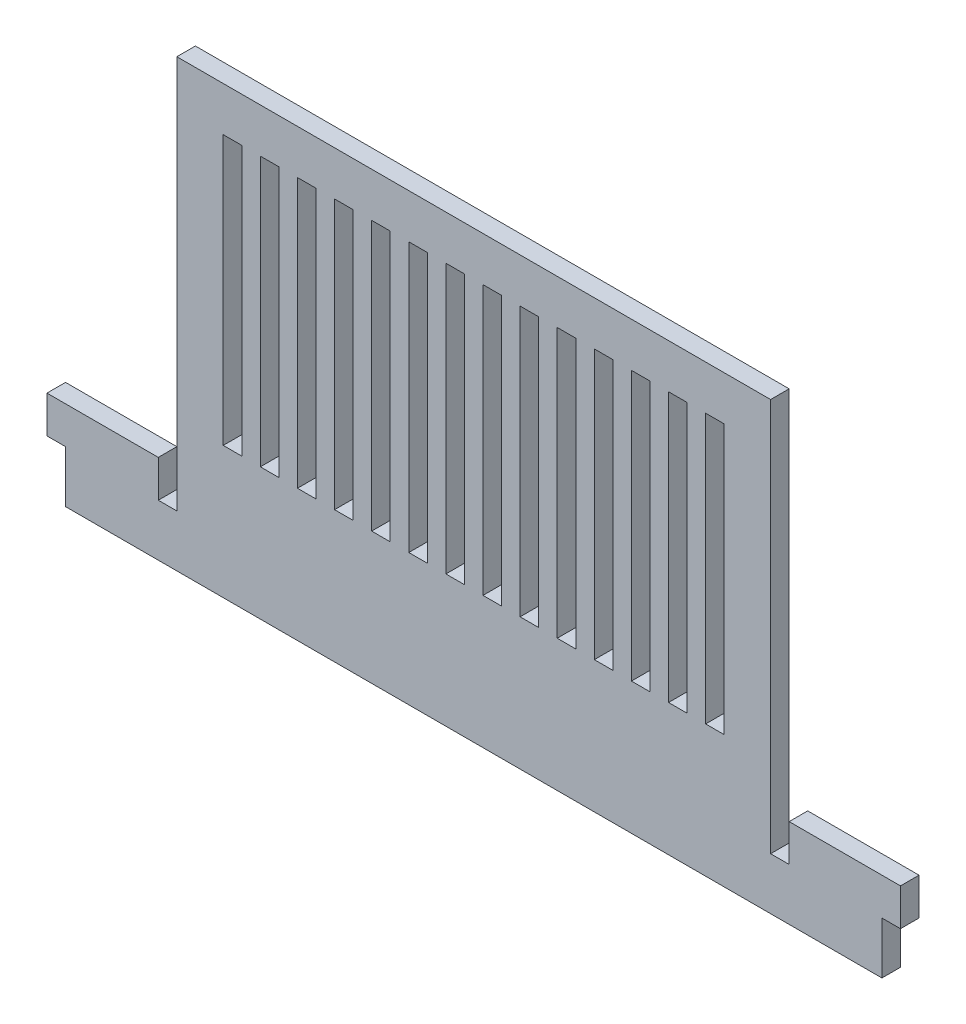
ISO-10303-21;
HEADER;
FILE_DESCRIPTION(('STEP AP214'),'2;1');
FILE_NAME('part.step','',(''),(''),'','','');
FILE_SCHEMA(('AUTOMOTIVE_DESIGN { 1 0 10303 214 1 1 1 1 }'));
ENDSEC;
DATA;
#1=APPLICATION_CONTEXT('core data for automotive mechanical design processes');
#2=APPLICATION_PROTOCOL_DEFINITION('international standard','automotive_design',2000,#1);
#3=PRODUCT_CONTEXT('',#1,'mechanical');
#4=PRODUCT('Part','Part','',(#3));
#5=PRODUCT_RELATED_PRODUCT_CATEGORY('part','',(#4));
#6=PRODUCT_DEFINITION_FORMATION('','',#4);
#7=PRODUCT_DEFINITION_CONTEXT('part definition',#1,'design');
#8=PRODUCT_DEFINITION('design','',#6,#7);
#9=PRODUCT_DEFINITION_SHAPE('','',#8);
#10=(LENGTH_UNIT() NAMED_UNIT(*) SI_UNIT(.MILLI.,.METRE.));
#11=(NAMED_UNIT(*) PLANE_ANGLE_UNIT() SI_UNIT($,.RADIAN.));
#12=(NAMED_UNIT(*) SI_UNIT($,.STERADIAN.) SOLID_ANGLE_UNIT());
#13=UNCERTAINTY_MEASURE_WITH_UNIT(LENGTH_MEASURE(1.E-05),#10,'distance_accuracy_value','');
#14=(GEOMETRIC_REPRESENTATION_CONTEXT(3) GLOBAL_UNCERTAINTY_ASSIGNED_CONTEXT((#13)) GLOBAL_UNIT_ASSIGNED_CONTEXT((#10,
#11,#12)) REPRESENTATION_CONTEXT('',''));
#15=CARTESIAN_POINT('',(0.,0.,0.));
#16=DIRECTION('',(0.,0.,1.));
#17=DIRECTION('',(1.,0.,0.));
#18=AXIS2_PLACEMENT_3D('',#15,#16,#17);
#19=CARTESIAN_POINT('',(-142.875,1.27,3.175));
#20=DIRECTION('',(0.,0.,1.));
#21=DIRECTION('',(1.,0.,0.));
#22=AXIS2_PLACEMENT_3D('',#19,#20,#21);
#23=PLANE('',#22);
#24=DIRECTION('',(-1.,0.,0.));
#25=VECTOR('',#24,1.);
#26=CARTESIAN_POINT('',(-80.9625,60.999160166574,3.175));
#27=LINE('',#26,#25);
#28=CARTESIAN_POINT('',(-80.9625,60.999160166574,3.175));
#29=VERTEX_POINT('',#28);
#30=CARTESIAN_POINT('',(-84.1375,60.999160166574,3.175));
#31=VERTEX_POINT('',#30);
#32=EDGE_CURVE('E519',#29,#31,#27,.T.);
#33=ORIENTED_EDGE('',*,*,#32,.F.);
#34=DIRECTION('',(0.,1.,0.));
#35=VECTOR('',#34,1.);
#36=CARTESIAN_POINT('',(-80.9625,14.949064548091,3.175));
#37=LINE('',#36,#35);
#38=CARTESIAN_POINT('',(-80.9625,14.949064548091,3.175));
#39=VERTEX_POINT('',#38);
#40=EDGE_CURVE('E517',#39,#29,#37,.T.);
#41=ORIENTED_EDGE('',*,*,#40,.F.);
#42=DIRECTION('',(1.,0.,0.));
#43=VECTOR('',#42,1.);
#44=CARTESIAN_POINT('',(-80.9625,14.949064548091,3.175));
#45=LINE('',#44,#43);
#46=CARTESIAN_POINT('',(-84.1375,14.949064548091,3.175));
#47=VERTEX_POINT('',#46);
#48=EDGE_CURVE('E525',#47,#39,#45,.T.);
#49=ORIENTED_EDGE('',*,*,#48,.F.);
#50=DIRECTION('',(0.,-1.,0.));
#51=VECTOR('',#50,1.);
#52=CARTESIAN_POINT('',(-84.1375,14.949064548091,3.175));
#53=LINE('',#52,#51);
#54=EDGE_CURVE('E522',#31,#47,#53,.T.);
#55=ORIENTED_EDGE('',*,*,#54,.F.);
#56=EDGE_LOOP('',(#33,#41,#49,#55));
#57=FACE_BOUND('',#56,.T.);
#58=DIRECTION('',(-1.,0.,0.));
#59=VECTOR('',#58,1.);
#60=CARTESIAN_POINT('',(-93.6625,60.999160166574,3.175));
#61=LINE('',#60,#59);
#62=CARTESIAN_POINT('',(-93.6625,60.999160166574,3.175));
#63=VERTEX_POINT('',#62);
#64=CARTESIAN_POINT('',(-96.8375,60.999160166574,3.175));
#65=VERTEX_POINT('',#64);
#66=EDGE_CURVE('E581',#63,#65,#61,.T.);
#67=ORIENTED_EDGE('',*,*,#66,.F.);
#68=DIRECTION('',(0.,1.,0.));
#69=VECTOR('',#68,1.);
#70=CARTESIAN_POINT('',(-93.6625,14.949064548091,3.175));
#71=LINE('',#70,#69);
#72=CARTESIAN_POINT('',(-93.6625,14.949064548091,3.175));
#73=VERTEX_POINT('',#72);
#74=EDGE_CURVE('E579',#73,#63,#71,.T.);
#75=ORIENTED_EDGE('',*,*,#74,.F.);
#76=DIRECTION('',(1.,0.,0.));
#77=VECTOR('',#76,1.);
#78=CARTESIAN_POINT('',(-93.6625,14.949064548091,3.175));
#79=LINE('',#78,#77);
#80=CARTESIAN_POINT('',(-96.8375,14.949064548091,3.175));
#81=VERTEX_POINT('',#80);
#82=EDGE_CURVE('E587',#81,#73,#79,.T.);
#83=ORIENTED_EDGE('',*,*,#82,.F.);
#84=DIRECTION('',(0.,-1.,0.));
#85=VECTOR('',#84,1.);
#86=CARTESIAN_POINT('',(-96.8375,14.949064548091,3.175));
#87=LINE('',#86,#85);
#88=EDGE_CURVE('E584',#65,#81,#87,.T.);
#89=ORIENTED_EDGE('',*,*,#88,.F.);
#90=EDGE_LOOP('',(#67,#75,#83,#89));
#91=FACE_BOUND('',#90,.T.);
#92=DIRECTION('',(-1.,0.,0.));
#93=VECTOR('',#92,1.);
#94=CARTESIAN_POINT('',(-106.3625,60.999160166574,3.175));
#95=LINE('',#94,#93);
#96=CARTESIAN_POINT('',(-106.3625,60.999160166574,3.175));
#97=VERTEX_POINT('',#96);
#98=CARTESIAN_POINT('',(-109.5375,60.999160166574,3.175));
#99=VERTEX_POINT('',#98);
#100=EDGE_CURVE('E643',#97,#99,#95,.T.);
#101=ORIENTED_EDGE('',*,*,#100,.F.);
#102=DIRECTION('',(0.,1.,0.));
#103=VECTOR('',#102,1.);
#104=CARTESIAN_POINT('',(-106.3625,14.949064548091,3.175));
#105=LINE('',#104,#103);
#106=CARTESIAN_POINT('',(-106.3625,14.949064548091,3.175));
#107=VERTEX_POINT('',#106);
#108=EDGE_CURVE('E641',#107,#97,#105,.T.);
#109=ORIENTED_EDGE('',*,*,#108,.F.);
#110=DIRECTION('',(1.,0.,0.));
#111=VECTOR('',#110,1.);
#112=CARTESIAN_POINT('',(-106.3625,14.949064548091,3.175));
#113=LINE('',#112,#111);
#114=CARTESIAN_POINT('',(-109.5375,14.949064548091,3.175));
#115=VERTEX_POINT('',#114);
#116=EDGE_CURVE('E649',#115,#107,#113,.T.);
#117=ORIENTED_EDGE('',*,*,#116,.F.);
#118=DIRECTION('',(0.,-1.,0.));
#119=VECTOR('',#118,1.);
#120=CARTESIAN_POINT('',(-109.5375,14.949064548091,3.175));
#121=LINE('',#120,#119);
#122=EDGE_CURVE('E646',#99,#115,#121,.T.);
#123=ORIENTED_EDGE('',*,*,#122,.F.);
#124=EDGE_LOOP('',(#101,#109,#117,#123));
#125=FACE_BOUND('',#124,.T.);
#126=DIRECTION('',(0.,1.,0.));
#127=VECTOR('',#126,1.);
#128=CARTESIAN_POINT('',(-42.8625,14.949064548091,3.175));
#129=LINE('',#128,#127);
#130=CARTESIAN_POINT('',(-42.8625,14.949064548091,3.175));
#131=VERTEX_POINT('',#130);
#132=CARTESIAN_POINT('',(-42.8625,60.999160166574,3.175));
#133=VERTEX_POINT('',#132);
#134=EDGE_CURVE('E705',#131,#133,#129,.T.);
#135=ORIENTED_EDGE('',*,*,#134,.F.);
#136=DIRECTION('',(1.,0.,0.));
#137=VECTOR('',#136,1.);
#138=CARTESIAN_POINT('',(-46.0375,14.949064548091,3.175));
#139=LINE('',#138,#137);
#140=CARTESIAN_POINT('',(-46.0375,14.949064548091,3.175));
#141=VERTEX_POINT('',#140);
#142=EDGE_CURVE('E703',#141,#131,#139,.T.);
#143=ORIENTED_EDGE('',*,*,#142,.F.);
#144=DIRECTION('',(0.,-1.,0.));
#145=VECTOR('',#144,1.);
#146=CARTESIAN_POINT('',(-46.0375,14.949064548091,3.175));
#147=LINE('',#146,#145);
#148=CARTESIAN_POINT('',(-46.0375,60.999160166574,3.175));
#149=VERTEX_POINT('',#148);
#150=EDGE_CURVE('E711',#149,#141,#147,.T.);
#151=ORIENTED_EDGE('',*,*,#150,.F.);
#152=DIRECTION('',(-1.,0.,0.));
#153=VECTOR('',#152,1.);
#154=CARTESIAN_POINT('',(-46.0375,60.999160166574,3.175));
#155=LINE('',#154,#153);
#156=EDGE_CURVE('E708',#133,#149,#155,.T.);
#157=ORIENTED_EDGE('',*,*,#156,.F.);
#158=EDGE_LOOP('',(#135,#143,#151,#157));
#159=FACE_BOUND('',#158,.T.);
#160=DIRECTION('',(0.,1.,0.));
#161=VECTOR('',#160,1.);
#162=CARTESIAN_POINT('',(-55.5625,14.949064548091,3.175));
#163=LINE('',#162,#161);
#164=CARTESIAN_POINT('',(-55.5625,14.949064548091,3.175));
#165=VERTEX_POINT('',#164);
#166=CARTESIAN_POINT('',(-55.5625,60.999160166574,3.175));
#167=VERTEX_POINT('',#166);
#168=EDGE_CURVE('E767',#165,#167,#163,.T.);
#169=ORIENTED_EDGE('',*,*,#168,.F.);
#170=DIRECTION('',(1.,0.,0.));
#171=VECTOR('',#170,1.);
#172=CARTESIAN_POINT('',(-58.7375,14.949064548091,3.175));
#173=LINE('',#172,#171);
#174=CARTESIAN_POINT('',(-58.7375,14.949064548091,3.175));
#175=VERTEX_POINT('',#174);
#176=EDGE_CURVE('E765',#175,#165,#173,.T.);
#177=ORIENTED_EDGE('',*,*,#176,.F.);
#178=DIRECTION('',(0.,-1.,0.));
#179=VECTOR('',#178,1.);
#180=CARTESIAN_POINT('',(-58.7375,14.949064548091,3.175));
#181=LINE('',#180,#179);
#182=CARTESIAN_POINT('',(-58.7375,60.999160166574,3.175));
#183=VERTEX_POINT('',#182);
#184=EDGE_CURVE('E773',#183,#175,#181,.T.);
#185=ORIENTED_EDGE('',*,*,#184,.F.);
#186=DIRECTION('',(-1.,0.,0.));
#187=VECTOR('',#186,1.);
#188=CARTESIAN_POINT('',(-58.7375,60.999160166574,3.175));
#189=LINE('',#188,#187);
#190=EDGE_CURVE('E770',#167,#183,#189,.T.);
#191=ORIENTED_EDGE('',*,*,#190,.F.);
#192=EDGE_LOOP('',(#169,#177,#185,#191));
#193=FACE_BOUND('',#192,.T.);
#194=DIRECTION('',(-1.,0.,0.));
#195=VECTOR('',#194,1.);
#196=CARTESIAN_POINT('',(-112.7125,60.999160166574,3.175));
#197=LINE('',#196,#195);
#198=CARTESIAN_POINT('',(-112.7125,60.999160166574,3.175));
#199=VERTEX_POINT('',#198);
#200=CARTESIAN_POINT('',(-115.8875,60.999160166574,3.175));
#201=VERTEX_POINT('',#200);
#202=EDGE_CURVE('E829',#199,#201,#197,.T.);
#203=ORIENTED_EDGE('',*,*,#202,.F.);
#204=DIRECTION('',(0.,1.,0.));
#205=VECTOR('',#204,1.);
#206=CARTESIAN_POINT('',(-112.7125,14.949064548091,3.175));
#207=LINE('',#206,#205);
#208=CARTESIAN_POINT('',(-112.7125,14.949064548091,3.175));
#209=VERTEX_POINT('',#208);
#210=EDGE_CURVE('E827',#209,#199,#207,.T.);
#211=ORIENTED_EDGE('',*,*,#210,.F.);
#212=DIRECTION('',(1.,0.,0.));
#213=VECTOR('',#212,1.);
#214=CARTESIAN_POINT('',(-112.7125,14.949064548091,3.175));
#215=LINE('',#214,#213);
#216=CARTESIAN_POINT('',(-115.8875,14.949064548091,3.175));
#217=VERTEX_POINT('',#216);
#218=EDGE_CURVE('E835',#217,#209,#215,.T.);
#219=ORIENTED_EDGE('',*,*,#218,.F.);
#220=DIRECTION('',(0.,-1.,0.));
#221=VECTOR('',#220,1.);
#222=CARTESIAN_POINT('',(-115.8875,14.949064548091,3.175));
#223=LINE('',#222,#221);
#224=EDGE_CURVE('E832',#201,#217,#223,.T.);
#225=ORIENTED_EDGE('',*,*,#224,.F.);
#226=EDGE_LOOP('',(#203,#211,#219,#225));
#227=FACE_BOUND('',#226,.T.);
#228=DIRECTION('',(0.,1.,0.));
#229=VECTOR('',#228,1.);
#230=CARTESIAN_POINT('',(-68.2625,14.949064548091,3.175));
#231=LINE('',#230,#229);
#232=CARTESIAN_POINT('',(-68.2625,14.949064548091,3.175));
#233=VERTEX_POINT('',#232);
#234=CARTESIAN_POINT('',(-68.2625,60.999160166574,3.175));
#235=VERTEX_POINT('',#234);
#236=EDGE_CURVE('E891',#233,#235,#231,.T.);
#237=ORIENTED_EDGE('',*,*,#236,.F.);
#238=DIRECTION('',(1.,0.,0.));
#239=VECTOR('',#238,1.);
#240=CARTESIAN_POINT('',(-71.4375,14.949064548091,3.175));
#241=LINE('',#240,#239);
#242=CARTESIAN_POINT('',(-71.4375,14.949064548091,3.175));
#243=VERTEX_POINT('',#242);
#244=EDGE_CURVE('E889',#243,#233,#241,.T.);
#245=ORIENTED_EDGE('',*,*,#244,.F.);
#246=DIRECTION('',(0.,-1.,0.));
#247=VECTOR('',#246,1.);
#248=CARTESIAN_POINT('',(-71.4375,14.949064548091,3.175));
#249=LINE('',#248,#247);
#250=CARTESIAN_POINT('',(-71.4375,60.999160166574,3.175));
#251=VERTEX_POINT('',#250);
#252=EDGE_CURVE('E897',#251,#243,#249,.T.);
#253=ORIENTED_EDGE('',*,*,#252,.F.);
#254=DIRECTION('',(-1.,0.,0.));
#255=VECTOR('',#254,1.);
#256=CARTESIAN_POINT('',(-71.4375,60.999160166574,3.175));
#257=LINE('',#256,#255);
#258=EDGE_CURVE('E894',#235,#251,#257,.T.);
#259=ORIENTED_EDGE('',*,*,#258,.F.);
#260=EDGE_LOOP('',(#237,#245,#253,#259));
#261=FACE_BOUND('',#260,.T.);
#262=DIRECTION('',(1.24884479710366E-13,-1.,0.));
#263=VECTOR('',#262,1.);
#264=CARTESIAN_POINT('',(-142.874999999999,-7.62000000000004,3.175));
#265=LINE('',#264,#263);
#266=CARTESIAN_POINT('',(-142.875,1.27,3.175));
#267=VERTEX_POINT('',#266);
#268=CARTESIAN_POINT('',(-142.874999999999,-7.62000000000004,3.175));
#269=VERTEX_POINT('',#268);
#270=EDGE_CURVE('E920',#267,#269,#265,.T.);
#271=ORIENTED_EDGE('',*,*,#270,.T.);
#272=DIRECTION('',(1.,0.,0.));
#273=VECTOR('',#272,1.);
#274=CARTESIAN_POINT('',(-142.874999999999,-7.62000000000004,3.175));
#275=LINE('',#274,#273);
#276=CARTESIAN_POINT('',(-3.17500000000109,-7.62,3.175));
#277=VERTEX_POINT('',#276);
#278=EDGE_CURVE('E923',#269,#277,#275,.T.);
#279=ORIENTED_EDGE('',*,*,#278,.T.);
#280=DIRECTION('',(1.23030725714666E-13,1.,0.));
#281=VECTOR('',#280,1.);
#282=CARTESIAN_POINT('',(-3.17500000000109,-7.62,3.175));
#283=LINE('',#282,#281);
#284=CARTESIAN_POINT('',(-3.175,1.27,3.175));
#285=VERTEX_POINT('',#284);
#286=EDGE_CURVE('E926',#277,#285,#283,.T.);
#287=ORIENTED_EDGE('',*,*,#286,.T.);
#288=DIRECTION('',(1.,0.,0.));
#289=VECTOR('',#288,1.);
#290=CARTESIAN_POINT('',(-3.175,1.27,3.175));
#291=LINE('',#290,#289);
#292=CARTESIAN_POINT('',(0.,1.27,3.175));
#293=VERTEX_POINT('',#292);
#294=EDGE_CURVE('E928',#285,#293,#291,.T.);
#295=ORIENTED_EDGE('',*,*,#294,.T.);
#296=DIRECTION('',(0.,1.,0.));
#297=VECTOR('',#296,1.);
#298=CARTESIAN_POINT('',(0.,1.27,3.175));
#299=LINE('',#298,#297);
#300=CARTESIAN_POINT('',(0.,7.62,3.175));
#301=VERTEX_POINT('',#300);
#302=EDGE_CURVE('E930',#293,#301,#299,.T.);
#303=ORIENTED_EDGE('',*,*,#302,.T.);
#304=DIRECTION('',(-1.,0.,0.));
#305=VECTOR('',#304,1.);
#306=CARTESIAN_POINT('',(0.,7.62,3.175));
#307=LINE('',#306,#305);
#308=CARTESIAN_POINT('',(-19.05,7.62,3.175));
#309=VERTEX_POINT('',#308);
#310=EDGE_CURVE('E932',#301,#309,#307,.T.);
#311=ORIENTED_EDGE('',*,*,#310,.T.);
#312=DIRECTION('',(0.,-1.,0.));
#313=VECTOR('',#312,1.);
#314=CARTESIAN_POINT('',(-19.05,1.27,3.175));
#315=LINE('',#314,#313);
#316=CARTESIAN_POINT('',(-19.05,1.27,3.175));
#317=VERTEX_POINT('',#316);
#318=EDGE_CURVE('E934',#309,#317,#315,.T.);
#319=ORIENTED_EDGE('',*,*,#318,.T.);
#320=DIRECTION('',(-1.,0.,0.));
#321=VECTOR('',#320,1.);
#322=CARTESIAN_POINT('',(-19.05,1.27,3.175));
#323=LINE('',#322,#321);
#324=CARTESIAN_POINT('',(-22.225,1.27,3.175));
#325=VERTEX_POINT('',#324);
#326=EDGE_CURVE('E936',#317,#325,#323,.T.);
#327=ORIENTED_EDGE('',*,*,#326,.T.);
#328=DIRECTION('',(0.,1.,0.));
#329=VECTOR('',#328,1.);
#330=CARTESIAN_POINT('',(-22.225,1.27,3.175));
#331=LINE('',#330,#329);
#332=CARTESIAN_POINT('',(-22.225,68.58,3.175));
#333=VERTEX_POINT('',#332);
#334=EDGE_CURVE('E938',#325,#333,#331,.T.);
#335=ORIENTED_EDGE('',*,*,#334,.T.);
#336=DIRECTION('',(-1.,0.,0.));
#337=VECTOR('',#336,1.);
#338=CARTESIAN_POINT('',(-123.825,68.58,3.175));
#339=LINE('',#338,#337);
#340=CARTESIAN_POINT('',(-123.825,68.58,3.175));
#341=VERTEX_POINT('',#340);
#342=EDGE_CURVE('E940',#333,#341,#339,.T.);
#343=ORIENTED_EDGE('',*,*,#342,.T.);
#344=DIRECTION('',(0.,-1.,0.));
#345=VECTOR('',#344,1.);
#346=CARTESIAN_POINT('',(-123.825,1.27,3.175));
#347=LINE('',#346,#345);
#348=CARTESIAN_POINT('',(-123.825,1.27,3.175));
#349=VERTEX_POINT('',#348);
#350=EDGE_CURVE('E942',#341,#349,#347,.T.);
#351=ORIENTED_EDGE('',*,*,#350,.T.);
#352=DIRECTION('',(-1.,0.,0.));
#353=VECTOR('',#352,1.);
#354=CARTESIAN_POINT('',(-127.,1.27,3.175));
#355=LINE('',#354,#353);
#356=CARTESIAN_POINT('',(-127.,1.27,3.175));
#357=VERTEX_POINT('',#356);
#358=EDGE_CURVE('E944',#349,#357,#355,.T.);
#359=ORIENTED_EDGE('',*,*,#358,.T.);
#360=DIRECTION('',(0.,1.,0.));
#361=VECTOR('',#360,1.);
#362=CARTESIAN_POINT('',(-127.,1.27,3.175));
#363=LINE('',#362,#361);
#364=CARTESIAN_POINT('',(-127.,7.62,3.175));
#365=VERTEX_POINT('',#364);
#366=EDGE_CURVE('E946',#357,#365,#363,.T.);
#367=ORIENTED_EDGE('',*,*,#366,.T.);
#368=DIRECTION('',(-1.,0.,0.));
#369=VECTOR('',#368,1.);
#370=CARTESIAN_POINT('',(-146.05,7.61999999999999,3.175));
#371=LINE('',#370,#369);
#372=CARTESIAN_POINT('',(-146.05,7.61999999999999,3.175));
#373=VERTEX_POINT('',#372);
#374=EDGE_CURVE('E948',#365,#373,#371,.T.);
#375=ORIENTED_EDGE('',*,*,#374,.T.);
#376=DIRECTION('',(0.,-1.,0.));
#377=VECTOR('',#376,1.);
#378=CARTESIAN_POINT('',(-146.05,1.27,3.175));
#379=LINE('',#378,#377);
#380=CARTESIAN_POINT('',(-146.05,1.27,3.175));
#381=VERTEX_POINT('',#380);
#382=EDGE_CURVE('E950',#373,#381,#379,.T.);
#383=ORIENTED_EDGE('',*,*,#382,.T.);
#384=DIRECTION('',(1.,0.,0.));
#385=VECTOR('',#384,1.);
#386=CARTESIAN_POINT('',(-142.875,1.27,3.175));
#387=LINE('',#386,#385);
#388=EDGE_CURVE('E952',#381,#267,#387,.T.);
#389=ORIENTED_EDGE('',*,*,#388,.T.);
#390=EDGE_LOOP('',(#271,#279,#287,#295,#303,#311,#319,#327,#335,#343,#351,#359,#367,#375,#383,#389));
#391=FACE_BOUND('',#390,.T.);
#392=DIRECTION('',(0.,1.,0.));
#393=VECTOR('',#392,1.);
#394=CARTESIAN_POINT('',(-30.1625,14.949064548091,3.175));
#395=LINE('',#394,#393);
#396=CARTESIAN_POINT('',(-30.1625,14.949064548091,3.175));
#397=VERTEX_POINT('',#396);
#398=CARTESIAN_POINT('',(-30.1625,60.999160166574,3.175));
#399=VERTEX_POINT('',#398);
#400=EDGE_CURVE('E860',#397,#399,#395,.T.);
#401=ORIENTED_EDGE('',*,*,#400,.F.);
#402=DIRECTION('',(1.,0.,0.));
#403=VECTOR('',#402,1.);
#404=CARTESIAN_POINT('',(-33.3375,14.949064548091,3.175));
#405=LINE('',#404,#403);
#406=CARTESIAN_POINT('',(-33.3375,14.949064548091,3.175));
#407=VERTEX_POINT('',#406);
#408=EDGE_CURVE('E858',#407,#397,#405,.T.);
#409=ORIENTED_EDGE('',*,*,#408,.F.);
#410=DIRECTION('',(0.,-1.,0.));
#411=VECTOR('',#410,1.);
#412=CARTESIAN_POINT('',(-33.3375,14.949064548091,3.175));
#413=LINE('',#412,#411);
#414=CARTESIAN_POINT('',(-33.3375,60.999160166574,3.175));
#415=VERTEX_POINT('',#414);
#416=EDGE_CURVE('E866',#415,#407,#413,.T.);
#417=ORIENTED_EDGE('',*,*,#416,.F.);
#418=DIRECTION('',(-1.,0.,0.));
#419=VECTOR('',#418,1.);
#420=CARTESIAN_POINT('',(-33.3375,60.999160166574,3.175));
#421=LINE('',#420,#419);
#422=EDGE_CURVE('E863',#399,#415,#421,.T.);
#423=ORIENTED_EDGE('',*,*,#422,.F.);
#424=EDGE_LOOP('',(#401,#409,#417,#423));
#425=FACE_BOUND('',#424,.T.);
#426=DIRECTION('',(0.,1.,0.));
#427=VECTOR('',#426,1.);
#428=CARTESIAN_POINT('',(-61.9125,14.949064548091,3.175));
#429=LINE('',#428,#427);
#430=CARTESIAN_POINT('',(-61.9125,14.949064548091,3.175));
#431=VERTEX_POINT('',#430);
#432=CARTESIAN_POINT('',(-61.9125,60.999160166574,3.175));
#433=VERTEX_POINT('',#432);
#434=EDGE_CURVE('E798',#431,#433,#429,.T.);
#435=ORIENTED_EDGE('',*,*,#434,.F.);
#436=DIRECTION('',(1.,0.,0.));
#437=VECTOR('',#436,1.);
#438=CARTESIAN_POINT('',(-65.0875,14.949064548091,3.175));
#439=LINE('',#438,#437);
#440=CARTESIAN_POINT('',(-65.0875,14.949064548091,3.175));
#441=VERTEX_POINT('',#440);
#442=EDGE_CURVE('E796',#441,#431,#439,.T.);
#443=ORIENTED_EDGE('',*,*,#442,.F.);
#444=DIRECTION('',(0.,-1.,0.));
#445=VECTOR('',#444,1.);
#446=CARTESIAN_POINT('',(-65.0875,14.949064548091,3.175));
#447=LINE('',#446,#445);
#448=CARTESIAN_POINT('',(-65.0875,60.999160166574,3.175));
#449=VERTEX_POINT('',#448);
#450=EDGE_CURVE('E804',#449,#441,#447,.T.);
#451=ORIENTED_EDGE('',*,*,#450,.F.);
#452=DIRECTION('',(-1.,0.,0.));
#453=VECTOR('',#452,1.);
#454=CARTESIAN_POINT('',(-65.0875,60.999160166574,3.175));
#455=LINE('',#454,#453);
#456=EDGE_CURVE('E801',#433,#449,#455,.T.);
#457=ORIENTED_EDGE('',*,*,#456,.F.);
#458=EDGE_LOOP('',(#435,#443,#451,#457));
#459=FACE_BOUND('',#458,.T.);
#460=DIRECTION('',(0.,1.,0.));
#461=VECTOR('',#460,1.);
#462=CARTESIAN_POINT('',(-49.2125,14.949064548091,3.175));
#463=LINE('',#462,#461);
#464=CARTESIAN_POINT('',(-49.2125,14.949064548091,3.175));
#465=VERTEX_POINT('',#464);
#466=CARTESIAN_POINT('',(-49.2125,60.999160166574,3.175));
#467=VERTEX_POINT('',#466);
#468=EDGE_CURVE('E736',#465,#467,#463,.T.);
#469=ORIENTED_EDGE('',*,*,#468,.F.);
#470=DIRECTION('',(1.,0.,0.));
#471=VECTOR('',#470,1.);
#472=CARTESIAN_POINT('',(-52.3875,14.949064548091,3.175));
#473=LINE('',#472,#471);
#474=CARTESIAN_POINT('',(-52.3875,14.949064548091,3.175));
#475=VERTEX_POINT('',#474);
#476=EDGE_CURVE('E734',#475,#465,#473,.T.);
#477=ORIENTED_EDGE('',*,*,#476,.F.);
#478=DIRECTION('',(0.,-1.,0.));
#479=VECTOR('',#478,1.);
#480=CARTESIAN_POINT('',(-52.3875,14.949064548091,3.175));
#481=LINE('',#480,#479);
#482=CARTESIAN_POINT('',(-52.3875,60.999160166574,3.175));
#483=VERTEX_POINT('',#482);
#484=EDGE_CURVE('E742',#483,#475,#481,.T.);
#485=ORIENTED_EDGE('',*,*,#484,.F.);
#486=DIRECTION('',(-1.,0.,0.));
#487=VECTOR('',#486,1.);
#488=CARTESIAN_POINT('',(-52.3875,60.999160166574,3.175));
#489=LINE('',#488,#487);
#490=EDGE_CURVE('E739',#467,#483,#489,.T.);
#491=ORIENTED_EDGE('',*,*,#490,.F.);
#492=EDGE_LOOP('',(#469,#477,#485,#491));
#493=FACE_BOUND('',#492,.T.);
#494=DIRECTION('',(0.,1.,0.));
#495=VECTOR('',#494,1.);
#496=CARTESIAN_POINT('',(-36.5125,14.949064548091,3.175));
#497=LINE('',#496,#495);
#498=CARTESIAN_POINT('',(-36.5125,14.949064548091,3.175));
#499=VERTEX_POINT('',#498);
#500=CARTESIAN_POINT('',(-36.5125,60.999160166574,3.175));
#501=VERTEX_POINT('',#500);
#502=EDGE_CURVE('E674',#499,#501,#497,.T.);
#503=ORIENTED_EDGE('',*,*,#502,.F.);
#504=DIRECTION('',(1.,0.,0.));
#505=VECTOR('',#504,1.);
#506=CARTESIAN_POINT('',(-39.6875,14.949064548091,3.175));
#507=LINE('',#506,#505);
#508=CARTESIAN_POINT('',(-39.6875,14.949064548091,3.175));
#509=VERTEX_POINT('',#508);
#510=EDGE_CURVE('E672',#509,#499,#507,.T.);
#511=ORIENTED_EDGE('',*,*,#510,.F.);
#512=DIRECTION('',(0.,-1.,0.));
#513=VECTOR('',#512,1.);
#514=CARTESIAN_POINT('',(-39.6875,14.949064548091,3.175));
#515=LINE('',#514,#513);
#516=CARTESIAN_POINT('',(-39.6875,60.999160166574,3.175));
#517=VERTEX_POINT('',#516);
#518=EDGE_CURVE('E680',#517,#509,#515,.T.);
#519=ORIENTED_EDGE('',*,*,#518,.F.);
#520=DIRECTION('',(-1.,0.,0.));
#521=VECTOR('',#520,1.);
#522=CARTESIAN_POINT('',(-39.6875,60.999160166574,3.175));
#523=LINE('',#522,#521);
#524=EDGE_CURVE('E677',#501,#517,#523,.T.);
#525=ORIENTED_EDGE('',*,*,#524,.F.);
#526=EDGE_LOOP('',(#503,#511,#519,#525));
#527=FACE_BOUND('',#526,.T.);
#528=DIRECTION('',(-1.,0.,0.));
#529=VECTOR('',#528,1.);
#530=CARTESIAN_POINT('',(-100.0125,60.999160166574,3.175));
#531=LINE('',#530,#529);
#532=CARTESIAN_POINT('',(-100.0125,60.999160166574,3.175));
#533=VERTEX_POINT('',#532);
#534=CARTESIAN_POINT('',(-103.1875,60.999160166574,3.175));
#535=VERTEX_POINT('',#534);
#536=EDGE_CURVE('E612',#533,#535,#531,.T.);
#537=ORIENTED_EDGE('',*,*,#536,.F.);
#538=DIRECTION('',(0.,1.,0.));
#539=VECTOR('',#538,1.);
#540=CARTESIAN_POINT('',(-100.0125,14.949064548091,3.175));
#541=LINE('',#540,#539);
#542=CARTESIAN_POINT('',(-100.0125,14.949064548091,3.175));
#543=VERTEX_POINT('',#542);
#544=EDGE_CURVE('E610',#543,#533,#541,.T.);
#545=ORIENTED_EDGE('',*,*,#544,.F.);
#546=DIRECTION('',(1.,0.,0.));
#547=VECTOR('',#546,1.);
#548=CARTESIAN_POINT('',(-100.0125,14.949064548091,3.175));
#549=LINE('',#548,#547);
#550=CARTESIAN_POINT('',(-103.1875,14.949064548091,3.175));
#551=VERTEX_POINT('',#550);
#552=EDGE_CURVE('E618',#551,#543,#549,.T.);
#553=ORIENTED_EDGE('',*,*,#552,.F.);
#554=DIRECTION('',(0.,-1.,0.));
#555=VECTOR('',#554,1.);
#556=CARTESIAN_POINT('',(-103.1875,14.949064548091,3.175));
#557=LINE('',#556,#555);
#558=EDGE_CURVE('E615',#535,#551,#557,.T.);
#559=ORIENTED_EDGE('',*,*,#558,.F.);
#560=EDGE_LOOP('',(#537,#545,#553,#559));
#561=FACE_BOUND('',#560,.T.);
#562=DIRECTION('',(-1.,0.,0.));
#563=VECTOR('',#562,1.);
#564=CARTESIAN_POINT('',(-87.3125,60.999160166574,3.175));
#565=LINE('',#564,#563);
#566=CARTESIAN_POINT('',(-87.3125,60.999160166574,3.175));
#567=VERTEX_POINT('',#566);
#568=CARTESIAN_POINT('',(-90.4875,60.999160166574,3.175));
#569=VERTEX_POINT('',#568);
#570=EDGE_CURVE('E550',#567,#569,#565,.T.);
#571=ORIENTED_EDGE('',*,*,#570,.F.);
#572=DIRECTION('',(0.,1.,0.));
#573=VECTOR('',#572,1.);
#574=CARTESIAN_POINT('',(-87.3125,14.949064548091,3.175));
#575=LINE('',#574,#573);
#576=CARTESIAN_POINT('',(-87.3125,14.949064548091,3.175));
#577=VERTEX_POINT('',#576);
#578=EDGE_CURVE('E548',#577,#567,#575,.T.);
#579=ORIENTED_EDGE('',*,*,#578,.F.);
#580=DIRECTION('',(1.,0.,0.));
#581=VECTOR('',#580,1.);
#582=CARTESIAN_POINT('',(-87.3125,14.949064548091,3.175));
#583=LINE('',#582,#581);
#584=CARTESIAN_POINT('',(-90.4875,14.949064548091,3.175));
#585=VERTEX_POINT('',#584);
#586=EDGE_CURVE('E556',#585,#577,#583,.T.);
#587=ORIENTED_EDGE('',*,*,#586,.F.);
#588=DIRECTION('',(0.,-1.,0.));
#589=VECTOR('',#588,1.);
#590=CARTESIAN_POINT('',(-90.4875,14.949064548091,3.175));
#591=LINE('',#590,#589);
#592=EDGE_CURVE('E553',#569,#585,#591,.T.);
#593=ORIENTED_EDGE('',*,*,#592,.F.);
#594=EDGE_LOOP('',(#571,#579,#587,#593));
#595=FACE_BOUND('',#594,.T.);
#596=DIRECTION('',(-1.,0.,0.));
#597=VECTOR('',#596,1.);
#598=CARTESIAN_POINT('',(-74.6125,60.999160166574,3.175));
#599=LINE('',#598,#597);
#600=CARTESIAN_POINT('',(-74.6125,60.999160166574,3.175));
#601=VERTEX_POINT('',#600);
#602=CARTESIAN_POINT('',(-77.7875,60.999160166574,3.175));
#603=VERTEX_POINT('',#602);
#604=EDGE_CURVE('E489',#601,#603,#599,.T.);
#605=ORIENTED_EDGE('',*,*,#604,.F.);
#606=DIRECTION('',(0.,1.,0.));
#607=VECTOR('',#606,1.);
#608=CARTESIAN_POINT('',(-74.6125,14.949064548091,3.175));
#609=LINE('',#608,#607);
#610=CARTESIAN_POINT('',(-74.6125,14.949064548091,3.175));
#611=VERTEX_POINT('',#610);
#612=EDGE_CURVE('E481',#611,#601,#609,.T.);
#613=ORIENTED_EDGE('',*,*,#612,.F.);
#614=DIRECTION('',(1.,0.,0.));
#615=VECTOR('',#614,1.);
#616=CARTESIAN_POINT('',(-74.6125,14.949064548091,3.175));
#617=LINE('',#616,#615);
#618=CARTESIAN_POINT('',(-77.7875,14.949064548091,3.175));
#619=VERTEX_POINT('',#618);
#620=EDGE_CURVE('E503',#619,#611,#617,.T.);
#621=ORIENTED_EDGE('',*,*,#620,.F.);
#622=DIRECTION('',(0.,-1.,0.));
#623=VECTOR('',#622,1.);
#624=CARTESIAN_POINT('',(-77.7875,14.949064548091,3.175));
#625=LINE('',#624,#623);
#626=EDGE_CURVE('E501',#603,#619,#625,.T.);
#627=ORIENTED_EDGE('',*,*,#626,.F.);
#628=EDGE_LOOP('',(#605,#613,#621,#627));
#629=FACE_BOUND('',#628,.T.);
#630=ADVANCED_FACE('F32',(#57,#91,#125,#159,#193,#227,#261,#391,#425,#459,#493,#527,#561,#595,
#629),#23,.T.);
#631=CARTESIAN_POINT('',(-142.875,1.27,0.));
#632=DIRECTION('',(0.,0.,1.));
#633=DIRECTION('',(1.,0.,0.));
#634=AXIS2_PLACEMENT_3D('',#631,#632,#633);
#635=PLANE('',#634);
#636=DIRECTION('',(0.,1.,0.));
#637=VECTOR('',#636,1.);
#638=CARTESIAN_POINT('',(-80.9625,14.949064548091,0.));
#639=LINE('',#638,#637);
#640=CARTESIAN_POINT('',(-80.9625,14.949064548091,0.));
#641=VERTEX_POINT('',#640);
#642=CARTESIAN_POINT('',(-80.9625,60.999160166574,0.));
#643=VERTEX_POINT('',#642);
#644=EDGE_CURVE('E497',#641,#643,#639,.T.);
#645=ORIENTED_EDGE('',*,*,#644,.T.);
#646=DIRECTION('',(-1.,0.,0.));
#647=VECTOR('',#646,1.);
#648=CARTESIAN_POINT('',(-80.9625,60.999160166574,0.));
#649=LINE('',#648,#647);
#650=CARTESIAN_POINT('',(-84.1375,60.999160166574,0.));
#651=VERTEX_POINT('',#650);
#652=EDGE_CURVE('E530',#643,#651,#649,.T.);
#653=ORIENTED_EDGE('',*,*,#652,.T.);
#654=DIRECTION('',(0.,-1.,0.));
#655=VECTOR('',#654,1.);
#656=CARTESIAN_POINT('',(-84.1375,14.949064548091,0.));
#657=LINE('',#656,#655);
#658=CARTESIAN_POINT('',(-84.1375,14.949064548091,0.));
#659=VERTEX_POINT('',#658);
#660=EDGE_CURVE('E533',#651,#659,#657,.T.);
#661=ORIENTED_EDGE('',*,*,#660,.T.);
#662=DIRECTION('',(1.,0.,0.));
#663=VECTOR('',#662,1.);
#664=CARTESIAN_POINT('',(-80.9625,14.949064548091,0.));
#665=LINE('',#664,#663);
#666=EDGE_CURVE('E520',#659,#641,#665,.T.);
#667=ORIENTED_EDGE('',*,*,#666,.T.);
#668=EDGE_LOOP('',(#645,#653,#661,#667));
#669=FACE_BOUND('',#668,.T.);
#670=DIRECTION('',(0.,1.,0.));
#671=VECTOR('',#670,1.);
#672=CARTESIAN_POINT('',(-93.6625,14.949064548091,0.));
#673=LINE('',#672,#671);
#674=CARTESIAN_POINT('',(-93.6625,14.949064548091,0.));
#675=VERTEX_POINT('',#674);
#676=CARTESIAN_POINT('',(-93.6625,60.999160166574,0.));
#677=VERTEX_POINT('',#676);
#678=EDGE_CURVE('E578',#675,#677,#673,.T.);
#679=ORIENTED_EDGE('',*,*,#678,.T.);
#680=DIRECTION('',(-1.,0.,0.));
#681=VECTOR('',#680,1.);
#682=CARTESIAN_POINT('',(-93.6625,60.999160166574,0.));
#683=LINE('',#682,#681);
#684=CARTESIAN_POINT('',(-96.8375,60.999160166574,0.));
#685=VERTEX_POINT('',#684);
#686=EDGE_CURVE('E592',#677,#685,#683,.T.);
#687=ORIENTED_EDGE('',*,*,#686,.T.);
#688=DIRECTION('',(0.,-1.,0.));
#689=VECTOR('',#688,1.);
#690=CARTESIAN_POINT('',(-96.8375,14.949064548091,0.));
#691=LINE('',#690,#689);
#692=CARTESIAN_POINT('',(-96.8375,14.949064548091,0.));
#693=VERTEX_POINT('',#692);
#694=EDGE_CURVE('E595',#685,#693,#691,.T.);
#695=ORIENTED_EDGE('',*,*,#694,.T.);
#696=DIRECTION('',(1.,0.,0.));
#697=VECTOR('',#696,1.);
#698=CARTESIAN_POINT('',(-93.6625,14.949064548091,0.));
#699=LINE('',#698,#697);
#700=EDGE_CURVE('E582',#693,#675,#699,.T.);
#701=ORIENTED_EDGE('',*,*,#700,.T.);
#702=EDGE_LOOP('',(#679,#687,#695,#701));
#703=FACE_BOUND('',#702,.T.);
#704=DIRECTION('',(0.,1.,0.));
#705=VECTOR('',#704,1.);
#706=CARTESIAN_POINT('',(-106.3625,14.949064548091,0.));
#707=LINE('',#706,#705);
#708=CARTESIAN_POINT('',(-106.3625,14.949064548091,0.));
#709=VERTEX_POINT('',#708);
#710=CARTESIAN_POINT('',(-106.3625,60.999160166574,0.));
#711=VERTEX_POINT('',#710);
#712=EDGE_CURVE('E640',#709,#711,#707,.T.);
#713=ORIENTED_EDGE('',*,*,#712,.T.);
#714=DIRECTION('',(-1.,0.,0.));
#715=VECTOR('',#714,1.);
#716=CARTESIAN_POINT('',(-106.3625,60.999160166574,0.));
#717=LINE('',#716,#715);
#718=CARTESIAN_POINT('',(-109.5375,60.999160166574,0.));
#719=VERTEX_POINT('',#718);
#720=EDGE_CURVE('E654',#711,#719,#717,.T.);
#721=ORIENTED_EDGE('',*,*,#720,.T.);
#722=DIRECTION('',(0.,-1.,0.));
#723=VECTOR('',#722,1.);
#724=CARTESIAN_POINT('',(-109.5375,14.949064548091,0.));
#725=LINE('',#724,#723);
#726=CARTESIAN_POINT('',(-109.5375,14.949064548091,0.));
#727=VERTEX_POINT('',#726);
#728=EDGE_CURVE('E657',#719,#727,#725,.T.);
#729=ORIENTED_EDGE('',*,*,#728,.T.);
#730=DIRECTION('',(1.,0.,0.));
#731=VECTOR('',#730,1.);
#732=CARTESIAN_POINT('',(-106.3625,14.949064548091,0.));
#733=LINE('',#732,#731);
#734=EDGE_CURVE('E644',#727,#709,#733,.T.);
#735=ORIENTED_EDGE('',*,*,#734,.T.);
#736=EDGE_LOOP('',(#713,#721,#729,#735));
#737=FACE_BOUND('',#736,.T.);
#738=DIRECTION('',(1.,0.,0.));
#739=VECTOR('',#738,1.);
#740=CARTESIAN_POINT('',(-46.0375,14.949064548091,0.));
#741=LINE('',#740,#739);
#742=CARTESIAN_POINT('',(-46.0375,14.949064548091,0.));
#743=VERTEX_POINT('',#742);
#744=CARTESIAN_POINT('',(-42.8625,14.949064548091,0.));
#745=VERTEX_POINT('',#744);
#746=EDGE_CURVE('E702',#743,#745,#741,.T.);
#747=ORIENTED_EDGE('',*,*,#746,.T.);
#748=DIRECTION('',(0.,1.,0.));
#749=VECTOR('',#748,1.);
#750=CARTESIAN_POINT('',(-42.8625,14.949064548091,0.));
#751=LINE('',#750,#749);
#752=CARTESIAN_POINT('',(-42.8625,60.999160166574,0.));
#753=VERTEX_POINT('',#752);
#754=EDGE_CURVE('E716',#745,#753,#751,.T.);
#755=ORIENTED_EDGE('',*,*,#754,.T.);
#756=DIRECTION('',(-1.,0.,0.));
#757=VECTOR('',#756,1.);
#758=CARTESIAN_POINT('',(-46.0375,60.999160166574,0.));
#759=LINE('',#758,#757);
#760=CARTESIAN_POINT('',(-46.0375,60.999160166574,0.));
#761=VERTEX_POINT('',#760);
#762=EDGE_CURVE('E719',#753,#761,#759,.T.);
#763=ORIENTED_EDGE('',*,*,#762,.T.);
#764=DIRECTION('',(0.,-1.,0.));
#765=VECTOR('',#764,1.);
#766=CARTESIAN_POINT('',(-46.0375,14.949064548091,0.));
#767=LINE('',#766,#765);
#768=EDGE_CURVE('E706',#761,#743,#767,.T.);
#769=ORIENTED_EDGE('',*,*,#768,.T.);
#770=EDGE_LOOP('',(#747,#755,#763,#769));
#771=FACE_BOUND('',#770,.T.);
#772=DIRECTION('',(1.,0.,0.));
#773=VECTOR('',#772,1.);
#774=CARTESIAN_POINT('',(-58.7375,14.949064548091,0.));
#775=LINE('',#774,#773);
#776=CARTESIAN_POINT('',(-58.7375,14.949064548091,0.));
#777=VERTEX_POINT('',#776);
#778=CARTESIAN_POINT('',(-55.5625,14.949064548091,0.));
#779=VERTEX_POINT('',#778);
#780=EDGE_CURVE('E764',#777,#779,#775,.T.);
#781=ORIENTED_EDGE('',*,*,#780,.T.);
#782=DIRECTION('',(0.,1.,0.));
#783=VECTOR('',#782,1.);
#784=CARTESIAN_POINT('',(-55.5625,14.949064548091,0.));
#785=LINE('',#784,#783);
#786=CARTESIAN_POINT('',(-55.5625,60.999160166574,0.));
#787=VERTEX_POINT('',#786);
#788=EDGE_CURVE('E778',#779,#787,#785,.T.);
#789=ORIENTED_EDGE('',*,*,#788,.T.);
#790=DIRECTION('',(-1.,0.,0.));
#791=VECTOR('',#790,1.);
#792=CARTESIAN_POINT('',(-58.7375,60.999160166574,0.));
#793=LINE('',#792,#791);
#794=CARTESIAN_POINT('',(-58.7375,60.999160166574,0.));
#795=VERTEX_POINT('',#794);
#796=EDGE_CURVE('E781',#787,#795,#793,.T.);
#797=ORIENTED_EDGE('',*,*,#796,.T.);
#798=DIRECTION('',(0.,-1.,0.));
#799=VECTOR('',#798,1.);
#800=CARTESIAN_POINT('',(-58.7375,14.949064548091,0.));
#801=LINE('',#800,#799);
#802=EDGE_CURVE('E768',#795,#777,#801,.T.);
#803=ORIENTED_EDGE('',*,*,#802,.T.);
#804=EDGE_LOOP('',(#781,#789,#797,#803));
#805=FACE_BOUND('',#804,.T.);
#806=DIRECTION('',(0.,1.,0.));
#807=VECTOR('',#806,1.);
#808=CARTESIAN_POINT('',(-112.7125,14.949064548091,0.));
#809=LINE('',#808,#807);
#810=CARTESIAN_POINT('',(-112.7125,14.949064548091,0.));
#811=VERTEX_POINT('',#810);
#812=CARTESIAN_POINT('',(-112.7125,60.999160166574,0.));
#813=VERTEX_POINT('',#812);
#814=EDGE_CURVE('E826',#811,#813,#809,.T.);
#815=ORIENTED_EDGE('',*,*,#814,.T.);
#816=DIRECTION('',(-1.,0.,0.));
#817=VECTOR('',#816,1.);
#818=CARTESIAN_POINT('',(-112.7125,60.999160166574,0.));
#819=LINE('',#818,#817);
#820=CARTESIAN_POINT('',(-115.8875,60.999160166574,0.));
#821=VERTEX_POINT('',#820);
#822=EDGE_CURVE('E840',#813,#821,#819,.T.);
#823=ORIENTED_EDGE('',*,*,#822,.T.);
#824=DIRECTION('',(0.,-1.,0.));
#825=VECTOR('',#824,1.);
#826=CARTESIAN_POINT('',(-115.8875,14.949064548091,0.));
#827=LINE('',#826,#825);
#828=CARTESIAN_POINT('',(-115.8875,14.949064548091,0.));
#829=VERTEX_POINT('',#828);
#830=EDGE_CURVE('E843',#821,#829,#827,.T.);
#831=ORIENTED_EDGE('',*,*,#830,.T.);
#832=DIRECTION('',(1.,0.,0.));
#833=VECTOR('',#832,1.);
#834=CARTESIAN_POINT('',(-112.7125,14.949064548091,0.));
#835=LINE('',#834,#833);
#836=EDGE_CURVE('E830',#829,#811,#835,.T.);
#837=ORIENTED_EDGE('',*,*,#836,.T.);
#838=EDGE_LOOP('',(#815,#823,#831,#837));
#839=FACE_BOUND('',#838,.T.);
#840=DIRECTION('',(1.,0.,0.));
#841=VECTOR('',#840,1.);
#842=CARTESIAN_POINT('',(-71.4375,14.949064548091,0.));
#843=LINE('',#842,#841);
#844=CARTESIAN_POINT('',(-71.4375,14.949064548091,0.));
#845=VERTEX_POINT('',#844);
#846=CARTESIAN_POINT('',(-68.2625,14.949064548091,0.));
#847=VERTEX_POINT('',#846);
#848=EDGE_CURVE('E888',#845,#847,#843,.T.);
#849=ORIENTED_EDGE('',*,*,#848,.T.);
#850=DIRECTION('',(0.,1.,0.));
#851=VECTOR('',#850,1.);
#852=CARTESIAN_POINT('',(-68.2625,14.949064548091,0.));
#853=LINE('',#852,#851);
#854=CARTESIAN_POINT('',(-68.2625,60.999160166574,0.));
#855=VERTEX_POINT('',#854);
#856=EDGE_CURVE('E902',#847,#855,#853,.T.);
#857=ORIENTED_EDGE('',*,*,#856,.T.);
#858=DIRECTION('',(-1.,0.,0.));
#859=VECTOR('',#858,1.);
#860=CARTESIAN_POINT('',(-71.4375,60.999160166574,0.));
#861=LINE('',#860,#859);
#862=CARTESIAN_POINT('',(-71.4375,60.999160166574,0.));
#863=VERTEX_POINT('',#862);
#864=EDGE_CURVE('E905',#855,#863,#861,.T.);
#865=ORIENTED_EDGE('',*,*,#864,.T.);
#866=DIRECTION('',(0.,-1.,0.));
#867=VECTOR('',#866,1.);
#868=CARTESIAN_POINT('',(-71.4375,14.949064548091,0.));
#869=LINE('',#868,#867);
#870=EDGE_CURVE('E892',#863,#845,#869,.T.);
#871=ORIENTED_EDGE('',*,*,#870,.T.);
#872=EDGE_LOOP('',(#849,#857,#865,#871));
#873=FACE_BOUND('',#872,.T.);
#874=DIRECTION('',(1.24884479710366E-13,-1.,0.));
#875=VECTOR('',#874,1.);
#876=CARTESIAN_POINT('',(-142.874999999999,-7.62000000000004,0.));
#877=LINE('',#876,#875);
#878=CARTESIAN_POINT('',(-142.875,1.27,0.));
#879=VERTEX_POINT('',#878);
#880=CARTESIAN_POINT('',(-142.874999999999,-7.62000000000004,0.));
#881=VERTEX_POINT('',#880);
#882=EDGE_CURVE('E919',#879,#881,#877,.T.);
#883=ORIENTED_EDGE('',*,*,#882,.F.);
#884=DIRECTION('',(1.,0.,0.));
#885=VECTOR('',#884,1.);
#886=CARTESIAN_POINT('',(-142.875,1.27,0.));
#887=LINE('',#886,#885);
#888=CARTESIAN_POINT('',(-146.05,1.27,0.));
#889=VERTEX_POINT('',#888);
#890=EDGE_CURVE('E924',#889,#879,#887,.T.);
#891=ORIENTED_EDGE('',*,*,#890,.F.);
#892=DIRECTION('',(0.,-1.,0.));
#893=VECTOR('',#892,1.);
#894=CARTESIAN_POINT('',(-146.05,1.27,0.));
#895=LINE('',#894,#893);
#896=CARTESIAN_POINT('',(-146.05,7.61999999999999,0.));
#897=VERTEX_POINT('',#896);
#898=EDGE_CURVE('E983',#897,#889,#895,.T.);
#899=ORIENTED_EDGE('',*,*,#898,.F.);
#900=DIRECTION('',(-1.,0.,0.));
#901=VECTOR('',#900,1.);
#902=CARTESIAN_POINT('',(-146.05,7.61999999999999,0.));
#903=LINE('',#902,#901);
#904=CARTESIAN_POINT('',(-127.,7.62,0.));
#905=VERTEX_POINT('',#904);
#906=EDGE_CURVE('E981',#905,#897,#903,.T.);
#907=ORIENTED_EDGE('',*,*,#906,.F.);
#908=DIRECTION('',(0.,1.,0.));
#909=VECTOR('',#908,1.);
#910=CARTESIAN_POINT('',(-127.,1.27,0.));
#911=LINE('',#910,#909);
#912=CARTESIAN_POINT('',(-127.,1.27,0.));
#913=VERTEX_POINT('',#912);
#914=EDGE_CURVE('E979',#913,#905,#911,.T.);
#915=ORIENTED_EDGE('',*,*,#914,.F.);
#916=DIRECTION('',(-1.,0.,0.));
#917=VECTOR('',#916,1.);
#918=CARTESIAN_POINT('',(-127.,1.27,0.));
#919=LINE('',#918,#917);
#920=CARTESIAN_POINT('',(-123.825,1.27,0.));
#921=VERTEX_POINT('',#920);
#922=EDGE_CURVE('E977',#921,#913,#919,.T.);
#923=ORIENTED_EDGE('',*,*,#922,.F.);
#924=DIRECTION('',(0.,-1.,0.));
#925=VECTOR('',#924,1.);
#926=CARTESIAN_POINT('',(-123.825,1.27,0.));
#927=LINE('',#926,#925);
#928=CARTESIAN_POINT('',(-123.825,68.58,0.));
#929=VERTEX_POINT('',#928);
#930=EDGE_CURVE('E975',#929,#921,#927,.T.);
#931=ORIENTED_EDGE('',*,*,#930,.F.);
#932=DIRECTION('',(-1.,0.,0.));
#933=VECTOR('',#932,1.);
#934=CARTESIAN_POINT('',(-123.825,68.58,0.));
#935=LINE('',#934,#933);
#936=CARTESIAN_POINT('',(-22.225,68.58,0.));
#937=VERTEX_POINT('',#936);
#938=EDGE_CURVE('E973',#937,#929,#935,.T.);
#939=ORIENTED_EDGE('',*,*,#938,.F.);
#940=DIRECTION('',(0.,1.,0.));
#941=VECTOR('',#940,1.);
#942=CARTESIAN_POINT('',(-22.225,1.27,0.));
#943=LINE('',#942,#941);
#944=CARTESIAN_POINT('',(-22.225,1.27,0.));
#945=VERTEX_POINT('',#944);
#946=EDGE_CURVE('E971',#945,#937,#943,.T.);
#947=ORIENTED_EDGE('',*,*,#946,.F.);
#948=DIRECTION('',(-1.,0.,0.));
#949=VECTOR('',#948,1.);
#950=CARTESIAN_POINT('',(-19.05,1.27,0.));
#951=LINE('',#950,#949);
#952=CARTESIAN_POINT('',(-19.05,1.27,0.));
#953=VERTEX_POINT('',#952);
#954=EDGE_CURVE('E969',#953,#945,#951,.T.);
#955=ORIENTED_EDGE('',*,*,#954,.F.);
#956=DIRECTION('',(0.,-1.,0.));
#957=VECTOR('',#956,1.);
#958=CARTESIAN_POINT('',(-19.05,1.27,0.));
#959=LINE('',#958,#957);
#960=CARTESIAN_POINT('',(-19.05,7.62,0.));
#961=VERTEX_POINT('',#960);
#962=EDGE_CURVE('E967',#961,#953,#959,.T.);
#963=ORIENTED_EDGE('',*,*,#962,.F.);
#964=DIRECTION('',(-1.,0.,0.));
#965=VECTOR('',#964,1.);
#966=CARTESIAN_POINT('',(0.,7.62,0.));
#967=LINE('',#966,#965);
#968=CARTESIAN_POINT('',(0.,7.62,0.));
#969=VERTEX_POINT('',#968);
#970=EDGE_CURVE('E965',#969,#961,#967,.T.);
#971=ORIENTED_EDGE('',*,*,#970,.F.);
#972=DIRECTION('',(0.,1.,0.));
#973=VECTOR('',#972,1.);
#974=CARTESIAN_POINT('',(0.,1.27,0.));
#975=LINE('',#974,#973);
#976=CARTESIAN_POINT('',(0.,1.27,0.));
#977=VERTEX_POINT('',#976);
#978=EDGE_CURVE('E963',#977,#969,#975,.T.);
#979=ORIENTED_EDGE('',*,*,#978,.F.);
#980=DIRECTION('',(1.,0.,0.));
#981=VECTOR('',#980,1.);
#982=CARTESIAN_POINT('',(-3.175,1.27,0.));
#983=LINE('',#982,#981);
#984=CARTESIAN_POINT('',(-3.175,1.27,0.));
#985=VERTEX_POINT('',#984);
#986=EDGE_CURVE('E961',#985,#977,#983,.T.);
#987=ORIENTED_EDGE('',*,*,#986,.F.);
#988=DIRECTION('',(1.23030725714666E-13,1.,0.));
#989=VECTOR('',#988,1.);
#990=CARTESIAN_POINT('',(-3.17500000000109,-7.62,0.));
#991=LINE('',#990,#989);
#992=CARTESIAN_POINT('',(-3.17500000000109,-7.62,0.));
#993=VERTEX_POINT('',#992);
#994=EDGE_CURVE('E959',#993,#985,#991,.T.);
#995=ORIENTED_EDGE('',*,*,#994,.F.);
#996=DIRECTION('',(1.,0.,0.));
#997=VECTOR('',#996,1.);
#998=CARTESIAN_POINT('',(-142.874999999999,-7.62000000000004,0.));
#999=LINE('',#998,#997);
#1000=EDGE_CURVE('E957',#881,#993,#999,.T.);
#1001=ORIENTED_EDGE('',*,*,#1000,.F.);
#1002=EDGE_LOOP('',(#883,#891,#899,#907,#915,#923,#931,#939,#947,#955,#963,#971,#979,#987,#995,#1001));
#1003=FACE_BOUND('',#1002,.T.);
#1004=DIRECTION('',(1.,0.,0.));
#1005=VECTOR('',#1004,1.);
#1006=CARTESIAN_POINT('',(-33.3375,14.949064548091,0.));
#1007=LINE('',#1006,#1005);
#1008=CARTESIAN_POINT('',(-33.3375,14.949064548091,0.));
#1009=VERTEX_POINT('',#1008);
#1010=CARTESIAN_POINT('',(-30.1625,14.949064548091,0.));
#1011=VERTEX_POINT('',#1010);
#1012=EDGE_CURVE('E857',#1009,#1011,#1007,.T.);
#1013=ORIENTED_EDGE('',*,*,#1012,.T.);
#1014=DIRECTION('',(0.,1.,0.));
#1015=VECTOR('',#1014,1.);
#1016=CARTESIAN_POINT('',(-30.1625,14.949064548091,0.));
#1017=LINE('',#1016,#1015);
#1018=CARTESIAN_POINT('',(-30.1625,60.999160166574,0.));
#1019=VERTEX_POINT('',#1018);
#1020=EDGE_CURVE('E871',#1011,#1019,#1017,.T.);
#1021=ORIENTED_EDGE('',*,*,#1020,.T.);
#1022=DIRECTION('',(-1.,0.,0.));
#1023=VECTOR('',#1022,1.);
#1024=CARTESIAN_POINT('',(-33.3375,60.999160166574,0.));
#1025=LINE('',#1024,#1023);
#1026=CARTESIAN_POINT('',(-33.3375,60.999160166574,0.));
#1027=VERTEX_POINT('',#1026);
#1028=EDGE_CURVE('E874',#1019,#1027,#1025,.T.);
#1029=ORIENTED_EDGE('',*,*,#1028,.T.);
#1030=DIRECTION('',(0.,-1.,0.));
#1031=VECTOR('',#1030,1.);
#1032=CARTESIAN_POINT('',(-33.3375,14.949064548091,0.));
#1033=LINE('',#1032,#1031);
#1034=EDGE_CURVE('E861',#1027,#1009,#1033,.T.);
#1035=ORIENTED_EDGE('',*,*,#1034,.T.);
#1036=EDGE_LOOP('',(#1013,#1021,#1029,#1035));
#1037=FACE_BOUND('',#1036,.T.);
#1038=DIRECTION('',(1.,0.,0.));
#1039=VECTOR('',#1038,1.);
#1040=CARTESIAN_POINT('',(-65.0875,14.949064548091,0.));
#1041=LINE('',#1040,#1039);
#1042=CARTESIAN_POINT('',(-65.0875,14.949064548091,0.));
#1043=VERTEX_POINT('',#1042);
#1044=CARTESIAN_POINT('',(-61.9125,14.949064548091,0.));
#1045=VERTEX_POINT('',#1044);
#1046=EDGE_CURVE('E795',#1043,#1045,#1041,.T.);
#1047=ORIENTED_EDGE('',*,*,#1046,.T.);
#1048=DIRECTION('',(0.,1.,0.));
#1049=VECTOR('',#1048,1.);
#1050=CARTESIAN_POINT('',(-61.9125,14.949064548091,0.));
#1051=LINE('',#1050,#1049);
#1052=CARTESIAN_POINT('',(-61.9125,60.999160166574,0.));
#1053=VERTEX_POINT('',#1052);
#1054=EDGE_CURVE('E809',#1045,#1053,#1051,.T.);
#1055=ORIENTED_EDGE('',*,*,#1054,.T.);
#1056=DIRECTION('',(-1.,0.,0.));
#1057=VECTOR('',#1056,1.);
#1058=CARTESIAN_POINT('',(-65.0875,60.999160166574,0.));
#1059=LINE('',#1058,#1057);
#1060=CARTESIAN_POINT('',(-65.0875,60.999160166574,0.));
#1061=VERTEX_POINT('',#1060);
#1062=EDGE_CURVE('E812',#1053,#1061,#1059,.T.);
#1063=ORIENTED_EDGE('',*,*,#1062,.T.);
#1064=DIRECTION('',(0.,-1.,0.));
#1065=VECTOR('',#1064,1.);
#1066=CARTESIAN_POINT('',(-65.0875,14.949064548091,0.));
#1067=LINE('',#1066,#1065);
#1068=EDGE_CURVE('E799',#1061,#1043,#1067,.T.);
#1069=ORIENTED_EDGE('',*,*,#1068,.T.);
#1070=EDGE_LOOP('',(#1047,#1055,#1063,#1069));
#1071=FACE_BOUND('',#1070,.T.);
#1072=DIRECTION('',(1.,0.,0.));
#1073=VECTOR('',#1072,1.);
#1074=CARTESIAN_POINT('',(-52.3875,14.949064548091,0.));
#1075=LINE('',#1074,#1073);
#1076=CARTESIAN_POINT('',(-52.3875,14.949064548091,0.));
#1077=VERTEX_POINT('',#1076);
#1078=CARTESIAN_POINT('',(-49.2125,14.949064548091,0.));
#1079=VERTEX_POINT('',#1078);
#1080=EDGE_CURVE('E733',#1077,#1079,#1075,.T.);
#1081=ORIENTED_EDGE('',*,*,#1080,.T.);
#1082=DIRECTION('',(0.,1.,0.));
#1083=VECTOR('',#1082,1.);
#1084=CARTESIAN_POINT('',(-49.2125,14.949064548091,0.));
#1085=LINE('',#1084,#1083);
#1086=CARTESIAN_POINT('',(-49.2125,60.999160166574,0.));
#1087=VERTEX_POINT('',#1086);
#1088=EDGE_CURVE('E747',#1079,#1087,#1085,.T.);
#1089=ORIENTED_EDGE('',*,*,#1088,.T.);
#1090=DIRECTION('',(-1.,0.,0.));
#1091=VECTOR('',#1090,1.);
#1092=CARTESIAN_POINT('',(-52.3875,60.999160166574,0.));
#1093=LINE('',#1092,#1091);
#1094=CARTESIAN_POINT('',(-52.3875,60.999160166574,0.));
#1095=VERTEX_POINT('',#1094);
#1096=EDGE_CURVE('E750',#1087,#1095,#1093,.T.);
#1097=ORIENTED_EDGE('',*,*,#1096,.T.);
#1098=DIRECTION('',(0.,-1.,0.));
#1099=VECTOR('',#1098,1.);
#1100=CARTESIAN_POINT('',(-52.3875,14.949064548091,0.));
#1101=LINE('',#1100,#1099);
#1102=EDGE_CURVE('E737',#1095,#1077,#1101,.T.);
#1103=ORIENTED_EDGE('',*,*,#1102,.T.);
#1104=EDGE_LOOP('',(#1081,#1089,#1097,#1103));
#1105=FACE_BOUND('',#1104,.T.);
#1106=DIRECTION('',(1.,0.,0.));
#1107=VECTOR('',#1106,1.);
#1108=CARTESIAN_POINT('',(-39.6875,14.949064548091,0.));
#1109=LINE('',#1108,#1107);
#1110=CARTESIAN_POINT('',(-39.6875,14.949064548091,0.));
#1111=VERTEX_POINT('',#1110);
#1112=CARTESIAN_POINT('',(-36.5125,14.949064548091,0.));
#1113=VERTEX_POINT('',#1112);
#1114=EDGE_CURVE('E671',#1111,#1113,#1109,.T.);
#1115=ORIENTED_EDGE('',*,*,#1114,.T.);
#1116=DIRECTION('',(0.,1.,0.));
#1117=VECTOR('',#1116,1.);
#1118=CARTESIAN_POINT('',(-36.5125,14.949064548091,0.));
#1119=LINE('',#1118,#1117);
#1120=CARTESIAN_POINT('',(-36.5125,60.999160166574,0.));
#1121=VERTEX_POINT('',#1120);
#1122=EDGE_CURVE('E685',#1113,#1121,#1119,.T.);
#1123=ORIENTED_EDGE('',*,*,#1122,.T.);
#1124=DIRECTION('',(-1.,0.,0.));
#1125=VECTOR('',#1124,1.);
#1126=CARTESIAN_POINT('',(-39.6875,60.999160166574,0.));
#1127=LINE('',#1126,#1125);
#1128=CARTESIAN_POINT('',(-39.6875,60.999160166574,0.));
#1129=VERTEX_POINT('',#1128);
#1130=EDGE_CURVE('E688',#1121,#1129,#1127,.T.);
#1131=ORIENTED_EDGE('',*,*,#1130,.T.);
#1132=DIRECTION('',(0.,-1.,0.));
#1133=VECTOR('',#1132,1.);
#1134=CARTESIAN_POINT('',(-39.6875,14.949064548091,0.));
#1135=LINE('',#1134,#1133);
#1136=EDGE_CURVE('E675',#1129,#1111,#1135,.T.);
#1137=ORIENTED_EDGE('',*,*,#1136,.T.);
#1138=EDGE_LOOP('',(#1115,#1123,#1131,#1137));
#1139=FACE_BOUND('',#1138,.T.);
#1140=DIRECTION('',(0.,1.,0.));
#1141=VECTOR('',#1140,1.);
#1142=CARTESIAN_POINT('',(-100.0125,14.949064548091,0.));
#1143=LINE('',#1142,#1141);
#1144=CARTESIAN_POINT('',(-100.0125,14.949064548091,0.));
#1145=VERTEX_POINT('',#1144);
#1146=CARTESIAN_POINT('',(-100.0125,60.999160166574,0.));
#1147=VERTEX_POINT('',#1146);
#1148=EDGE_CURVE('E609',#1145,#1147,#1143,.T.);
#1149=ORIENTED_EDGE('',*,*,#1148,.T.);
#1150=DIRECTION('',(-1.,0.,0.));
#1151=VECTOR('',#1150,1.);
#1152=CARTESIAN_POINT('',(-100.0125,60.999160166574,0.));
#1153=LINE('',#1152,#1151);
#1154=CARTESIAN_POINT('',(-103.1875,60.999160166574,0.));
#1155=VERTEX_POINT('',#1154);
#1156=EDGE_CURVE('E623',#1147,#1155,#1153,.T.);
#1157=ORIENTED_EDGE('',*,*,#1156,.T.);
#1158=DIRECTION('',(0.,-1.,0.));
#1159=VECTOR('',#1158,1.);
#1160=CARTESIAN_POINT('',(-103.1875,14.949064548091,0.));
#1161=LINE('',#1160,#1159);
#1162=CARTESIAN_POINT('',(-103.1875,14.949064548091,0.));
#1163=VERTEX_POINT('',#1162);
#1164=EDGE_CURVE('E626',#1155,#1163,#1161,.T.);
#1165=ORIENTED_EDGE('',*,*,#1164,.T.);
#1166=DIRECTION('',(1.,0.,0.));
#1167=VECTOR('',#1166,1.);
#1168=CARTESIAN_POINT('',(-100.0125,14.949064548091,0.));
#1169=LINE('',#1168,#1167);
#1170=EDGE_CURVE('E613',#1163,#1145,#1169,.T.);
#1171=ORIENTED_EDGE('',*,*,#1170,.T.);
#1172=EDGE_LOOP('',(#1149,#1157,#1165,#1171));
#1173=FACE_BOUND('',#1172,.T.);
#1174=DIRECTION('',(0.,1.,0.));
#1175=VECTOR('',#1174,1.);
#1176=CARTESIAN_POINT('',(-87.3125,14.949064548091,0.));
#1177=LINE('',#1176,#1175);
#1178=CARTESIAN_POINT('',(-87.3125,14.949064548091,0.));
#1179=VERTEX_POINT('',#1178);
#1180=CARTESIAN_POINT('',(-87.3125,60.999160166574,0.));
#1181=VERTEX_POINT('',#1180);
#1182=EDGE_CURVE('E547',#1179,#1181,#1177,.T.);
#1183=ORIENTED_EDGE('',*,*,#1182,.T.);
#1184=DIRECTION('',(-1.,0.,0.));
#1185=VECTOR('',#1184,1.);
#1186=CARTESIAN_POINT('',(-87.3125,60.999160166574,0.));
#1187=LINE('',#1186,#1185);
#1188=CARTESIAN_POINT('',(-90.4875,60.999160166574,0.));
#1189=VERTEX_POINT('',#1188);
#1190=EDGE_CURVE('E561',#1181,#1189,#1187,.T.);
#1191=ORIENTED_EDGE('',*,*,#1190,.T.);
#1192=DIRECTION('',(0.,-1.,0.));
#1193=VECTOR('',#1192,1.);
#1194=CARTESIAN_POINT('',(-90.4875,14.949064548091,0.));
#1195=LINE('',#1194,#1193);
#1196=CARTESIAN_POINT('',(-90.4875,14.949064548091,0.));
#1197=VERTEX_POINT('',#1196);
#1198=EDGE_CURVE('E564',#1189,#1197,#1195,.T.);
#1199=ORIENTED_EDGE('',*,*,#1198,.T.);
#1200=DIRECTION('',(1.,0.,0.));
#1201=VECTOR('',#1200,1.);
#1202=CARTESIAN_POINT('',(-87.3125,14.949064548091,0.));
#1203=LINE('',#1202,#1201);
#1204=EDGE_CURVE('E551',#1197,#1179,#1203,.T.);
#1205=ORIENTED_EDGE('',*,*,#1204,.T.);
#1206=EDGE_LOOP('',(#1183,#1191,#1199,#1205));
#1207=FACE_BOUND('',#1206,.T.);
#1208=DIRECTION('',(0.,1.,0.));
#1209=VECTOR('',#1208,1.);
#1210=CARTESIAN_POINT('',(-74.6125,14.949064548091,0.));
#1211=LINE('',#1210,#1209);
#1212=CARTESIAN_POINT('',(-74.6125,14.949064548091,0.));
#1213=VERTEX_POINT('',#1212);
#1214=CARTESIAN_POINT('',(-74.6125,60.999160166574,0.));
#1215=VERTEX_POINT('',#1214);
#1216=EDGE_CURVE('E55',#1213,#1215,#1211,.T.);
#1217=ORIENTED_EDGE('',*,*,#1216,.T.);
#1218=DIRECTION('',(-1.,0.,0.));
#1219=VECTOR('',#1218,1.);
#1220=CARTESIAN_POINT('',(-74.6125,60.999160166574,0.));
#1221=LINE('',#1220,#1219);
#1222=CARTESIAN_POINT('',(-77.7875,60.999160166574,0.));
#1223=VERTEX_POINT('',#1222);
#1224=EDGE_CURVE('E496',#1215,#1223,#1221,.T.);
#1225=ORIENTED_EDGE('',*,*,#1224,.T.);
#1226=DIRECTION('',(0.,-1.,0.));
#1227=VECTOR('',#1226,1.);
#1228=CARTESIAN_POINT('',(-77.7875,14.949064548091,0.));
#1229=LINE('',#1228,#1227);
#1230=CARTESIAN_POINT('',(-77.7875,14.949064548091,0.));
#1231=VERTEX_POINT('',#1230);
#1232=EDGE_CURVE('E509',#1223,#1231,#1229,.T.);
#1233=ORIENTED_EDGE('',*,*,#1232,.T.);
#1234=DIRECTION('',(1.,0.,0.));
#1235=VECTOR('',#1234,1.);
#1236=CARTESIAN_POINT('',(-74.6125,14.949064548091,0.));
#1237=LINE('',#1236,#1235);
#1238=EDGE_CURVE('E490',#1231,#1213,#1237,.T.);
#1239=ORIENTED_EDGE('',*,*,#1238,.T.);
#1240=EDGE_LOOP('',(#1217,#1225,#1233,#1239));
#1241=FACE_BOUND('',#1240,.T.);
#1242=ADVANCED_FACE('F1037',(#669,#703,#737,#771,#805,#839,#873,#1003,#1037,#1071,#1105,#1139,
#1173,#1207,#1241),#635,.F.);
#1243=CARTESIAN_POINT('',(-142.874999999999,-7.62000000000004,3.175));
#1244=DIRECTION('',(1.,1.24884479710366E-13,0.));
#1245=DIRECTION('',(-1.24884479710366E-13,1.,0.));
#1246=AXIS2_PLACEMENT_3D('',#1243,#1244,#1245);
#1247=PLANE('',#1246);
#1248=ORIENTED_EDGE('',*,*,#882,.T.);
#1249=DIRECTION('',(0.,0.,-1.));
#1250=VECTOR('',#1249,1.);
#1251=CARTESIAN_POINT('',(-142.874999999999,-7.62000000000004,3.175));
#1252=LINE('',#1251,#1250);
#1253=EDGE_CURVE('E11',#269,#881,#1252,.T.);
#1254=ORIENTED_EDGE('',*,*,#1253,.F.);
#1255=ORIENTED_EDGE('',*,*,#270,.F.);
#1256=DIRECTION('',(0.,0.,-1.));
#1257=VECTOR('',#1256,1.);
#1258=CARTESIAN_POINT('',(-142.875,1.27,3.175));
#1259=LINE('',#1258,#1257);
#1260=EDGE_CURVE('E954',#267,#879,#1259,.T.);
#1261=ORIENTED_EDGE('',*,*,#1260,.T.);
#1262=EDGE_LOOP('',(#1248,#1254,#1255,#1261));
#1263=FACE_BOUND('',#1262,.T.);
#1264=ADVANCED_FACE('F34',(#1263),#1247,.F.);
#1265=CARTESIAN_POINT('',(-142.874999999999,-7.62000000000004,3.175));
#1266=DIRECTION('',(0.,1.,0.));
#1267=DIRECTION('',(-1.,0.,0.));
#1268=AXIS2_PLACEMENT_3D('',#1265,#1266,#1267);
#1269=PLANE('',#1268);
#1270=ORIENTED_EDGE('',*,*,#1000,.T.);
#1271=DIRECTION('',(0.,0.,-1.));
#1272=VECTOR('',#1271,1.);
#1273=CARTESIAN_POINT('',(-3.17500000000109,-7.62,3.175));
#1274=LINE('',#1273,#1272);
#1275=EDGE_CURVE('E40',#277,#993,#1274,.T.);
#1276=ORIENTED_EDGE('',*,*,#1275,.F.);
#1277=ORIENTED_EDGE('',*,*,#278,.F.);
#1278=ORIENTED_EDGE('',*,*,#1253,.T.);
#1279=EDGE_LOOP('',(#1270,#1276,#1277,#1278));
#1280=FACE_BOUND('',#1279,.T.);
#1281=ADVANCED_FACE('F1055',(#1280),#1269,.F.);
#1282=CARTESIAN_POINT('',(-3.17500000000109,-7.62,3.175));
#1283=DIRECTION('',(-1.,1.23030725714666E-13,0.));
#1284=DIRECTION('',(-1.23030725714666E-13,-1.,0.));
#1285=AXIS2_PLACEMENT_3D('',#1282,#1283,#1284);
#1286=PLANE('',#1285);
#1287=ORIENTED_EDGE('',*,*,#994,.T.);
#1288=DIRECTION('',(0.,0.,-1.));
#1289=VECTOR('',#1288,1.);
#1290=CARTESIAN_POINT('',(-3.175,1.27,3.175));
#1291=LINE('',#1290,#1289);
#1292=EDGE_CURVE('E1024',#285,#985,#1291,.T.);
#1293=ORIENTED_EDGE('',*,*,#1292,.F.);
#1294=ORIENTED_EDGE('',*,*,#286,.F.);
#1295=ORIENTED_EDGE('',*,*,#1275,.T.);
#1296=EDGE_LOOP('',(#1287,#1293,#1294,#1295));
#1297=FACE_BOUND('',#1296,.T.);
#1298=ADVANCED_FACE('F1031',(#1297),#1286,.F.);
#1299=CARTESIAN_POINT('',(-3.175,1.27,3.175));
#1300=DIRECTION('',(0.,1.,0.));
#1301=DIRECTION('',(0.,0.,1.));
#1302=AXIS2_PLACEMENT_3D('',#1299,#1300,#1301);
#1303=PLANE('',#1302);
#1304=ORIENTED_EDGE('',*,*,#986,.T.);
#1305=DIRECTION('',(0.,0.,-1.));
#1306=VECTOR('',#1305,1.);
#1307=CARTESIAN_POINT('',(0.,1.27,3.175));
#1308=LINE('',#1307,#1306);
#1309=EDGE_CURVE('E1021',#293,#977,#1308,.T.);
#1310=ORIENTED_EDGE('',*,*,#1309,.F.);
#1311=ORIENTED_EDGE('',*,*,#294,.F.);
#1312=ORIENTED_EDGE('',*,*,#1292,.T.);
#1313=EDGE_LOOP('',(#1304,#1310,#1311,#1312));
#1314=FACE_BOUND('',#1313,.T.);
#1315=ADVANCED_FACE('F1043',(#1314),#1303,.F.);
#1316=CARTESIAN_POINT('',(0.,1.27,3.175));
#1317=DIRECTION('',(-1.,0.,0.));
#1318=DIRECTION('',(0.,0.,1.));
#1319=AXIS2_PLACEMENT_3D('',#1316,#1317,#1318);
#1320=PLANE('',#1319);
#1321=ORIENTED_EDGE('',*,*,#978,.T.);
#1322=DIRECTION('',(0.,0.,-1.));
#1323=VECTOR('',#1322,1.);
#1324=CARTESIAN_POINT('',(0.,7.62,3.175));
#1325=LINE('',#1324,#1323);
#1326=EDGE_CURVE('E1018',#301,#969,#1325,.T.);
#1327=ORIENTED_EDGE('',*,*,#1326,.F.);
#1328=ORIENTED_EDGE('',*,*,#302,.F.);
#1329=ORIENTED_EDGE('',*,*,#1309,.T.);
#1330=EDGE_LOOP('',(#1321,#1327,#1328,#1329));
#1331=FACE_BOUND('',#1330,.T.);
#1332=ADVANCED_FACE('F1047',(#1331),#1320,.F.);
#1333=CARTESIAN_POINT('',(0.,7.62,3.175));
#1334=DIRECTION('',(0.,-1.,0.));
#1335=DIRECTION('',(1.,0.,0.));
#1336=AXIS2_PLACEMENT_3D('',#1333,#1334,#1335);
#1337=PLANE('',#1336);
#1338=ORIENTED_EDGE('',*,*,#970,.T.);
#1339=DIRECTION('',(0.,0.,-1.));
#1340=VECTOR('',#1339,1.);
#1341=CARTESIAN_POINT('',(-19.05,7.62,3.175));
#1342=LINE('',#1341,#1340);
#1343=EDGE_CURVE('E1015',#309,#961,#1342,.T.);
#1344=ORIENTED_EDGE('',*,*,#1343,.F.);
#1345=ORIENTED_EDGE('',*,*,#310,.F.);
#1346=ORIENTED_EDGE('',*,*,#1326,.T.);
#1347=EDGE_LOOP('',(#1338,#1344,#1345,#1346));
#1348=FACE_BOUND('',#1347,.T.);
#1349=ADVANCED_FACE('F1108',(#1348),#1337,.F.);
#1350=CARTESIAN_POINT('',(-19.05,1.27,3.175));
#1351=DIRECTION('',(1.,0.,0.));
#1352=DIRECTION('',(0.,0.,-1.));
#1353=AXIS2_PLACEMENT_3D('',#1350,#1351,#1352);
#1354=PLANE('',#1353);
#1355=ORIENTED_EDGE('',*,*,#962,.T.);
#1356=DIRECTION('',(0.,0.,-1.));
#1357=VECTOR('',#1356,1.);
#1358=CARTESIAN_POINT('',(-19.05,1.27,3.175));
#1359=LINE('',#1358,#1357);
#1360=EDGE_CURVE('E1012',#317,#953,#1359,.T.);
#1361=ORIENTED_EDGE('',*,*,#1360,.F.);
#1362=ORIENTED_EDGE('',*,*,#318,.F.);
#1363=ORIENTED_EDGE('',*,*,#1343,.T.);
#1364=EDGE_LOOP('',(#1355,#1361,#1362,#1363));
#1365=FACE_BOUND('',#1364,.T.);
#1366=ADVANCED_FACE('F1105',(#1365),#1354,.F.);
#1367=CARTESIAN_POINT('',(-19.05,1.27,3.175));
#1368=DIRECTION('',(0.,-1.,0.));
#1369=DIRECTION('',(1.,0.,0.));
#1370=AXIS2_PLACEMENT_3D('',#1367,#1368,#1369);
#1371=PLANE('',#1370);
#1372=ORIENTED_EDGE('',*,*,#954,.T.);
#1373=DIRECTION('',(0.,0.,-1.));
#1374=VECTOR('',#1373,1.);
#1375=CARTESIAN_POINT('',(-22.225,1.27,3.175));
#1376=LINE('',#1375,#1374);
#1377=EDGE_CURVE('E1009',#325,#945,#1376,.T.);
#1378=ORIENTED_EDGE('',*,*,#1377,.F.);
#1379=ORIENTED_EDGE('',*,*,#326,.F.);
#1380=ORIENTED_EDGE('',*,*,#1360,.T.);
#1381=EDGE_LOOP('',(#1372,#1378,#1379,#1380));
#1382=FACE_BOUND('',#1381,.T.);
#1383=ADVANCED_FACE('F1101',(#1382),#1371,.F.);
#1384=CARTESIAN_POINT('',(-22.225,1.27,3.175));
#1385=DIRECTION('',(-1.,0.,0.));
#1386=DIRECTION('',(0.,-1.,0.));
#1387=AXIS2_PLACEMENT_3D('',#1384,#1385,#1386);
#1388=PLANE('',#1387);
#1389=ORIENTED_EDGE('',*,*,#946,.T.);
#1390=DIRECTION('',(0.,0.,-1.));
#1391=VECTOR('',#1390,1.);
#1392=CARTESIAN_POINT('',(-22.225,68.58,3.175));
#1393=LINE('',#1392,#1391);
#1394=EDGE_CURVE('E1006',#333,#937,#1393,.T.);
#1395=ORIENTED_EDGE('',*,*,#1394,.F.);
#1396=ORIENTED_EDGE('',*,*,#334,.F.);
#1397=ORIENTED_EDGE('',*,*,#1377,.T.);
#1398=EDGE_LOOP('',(#1389,#1395,#1396,#1397));
#1399=FACE_BOUND('',#1398,.T.);
#1400=ADVANCED_FACE('F1097',(#1399),#1388,.F.);
#1401=CARTESIAN_POINT('',(-123.825,68.58,3.175));
#1402=DIRECTION('',(0.,-1.,0.));
#1403=DIRECTION('',(0.,0.,-1.));
#1404=AXIS2_PLACEMENT_3D('',#1401,#1402,#1403);
#1405=PLANE('',#1404);
#1406=ORIENTED_EDGE('',*,*,#938,.T.);
#1407=DIRECTION('',(0.,0.,-1.));
#1408=VECTOR('',#1407,1.);
#1409=CARTESIAN_POINT('',(-123.825,68.58,3.175));
#1410=LINE('',#1409,#1408);
#1411=EDGE_CURVE('E1003',#341,#929,#1410,.T.);
#1412=ORIENTED_EDGE('',*,*,#1411,.F.);
#1413=ORIENTED_EDGE('',*,*,#342,.F.);
#1414=ORIENTED_EDGE('',*,*,#1394,.T.);
#1415=EDGE_LOOP('',(#1406,#1412,#1413,#1414));
#1416=FACE_BOUND('',#1415,.T.);
#1417=ADVANCED_FACE('F1092',(#1416),#1405,.F.);
#1418=CARTESIAN_POINT('',(-123.825,1.27,3.175));
#1419=DIRECTION('',(1.,0.,0.));
#1420=DIRECTION('',(0.,0.,-1.));
#1421=AXIS2_PLACEMENT_3D('',#1418,#1419,#1420);
#1422=PLANE('',#1421);
#1423=ORIENTED_EDGE('',*,*,#930,.T.);
#1424=DIRECTION('',(0.,0.,-1.));
#1425=VECTOR('',#1424,1.);
#1426=CARTESIAN_POINT('',(-123.825,1.27,3.175));
#1427=LINE('',#1426,#1425);
#1428=EDGE_CURVE('E1000',#349,#921,#1427,.T.);
#1429=ORIENTED_EDGE('',*,*,#1428,.F.);
#1430=ORIENTED_EDGE('',*,*,#350,.F.);
#1431=ORIENTED_EDGE('',*,*,#1411,.T.);
#1432=EDGE_LOOP('',(#1423,#1429,#1430,#1431));
#1433=FACE_BOUND('',#1432,.T.);
#1434=ADVANCED_FACE('F1086',(#1433),#1422,.F.);
#1435=CARTESIAN_POINT('',(-127.,1.27,3.175));
#1436=DIRECTION('',(0.,-1.,0.));
#1437=DIRECTION('',(1.,0.,0.));
#1438=AXIS2_PLACEMENT_3D('',#1435,#1436,#1437);
#1439=PLANE('',#1438);
#1440=ORIENTED_EDGE('',*,*,#922,.T.);
#1441=DIRECTION('',(0.,0.,-1.));
#1442=VECTOR('',#1441,1.);
#1443=CARTESIAN_POINT('',(-127.,1.27,3.175));
#1444=LINE('',#1443,#1442);
#1445=EDGE_CURVE('E997',#357,#913,#1444,.T.);
#1446=ORIENTED_EDGE('',*,*,#1445,.F.);
#1447=ORIENTED_EDGE('',*,*,#358,.F.);
#1448=ORIENTED_EDGE('',*,*,#1428,.T.);
#1449=EDGE_LOOP('',(#1440,#1446,#1447,#1448));
#1450=FACE_BOUND('',#1449,.T.);
#1451=ADVANCED_FACE('F1082',(#1450),#1439,.F.);
#1452=CARTESIAN_POINT('',(-127.,1.27,3.175));
#1453=DIRECTION('',(-1.,0.,0.));
#1454=DIRECTION('',(0.,0.,1.));
#1455=AXIS2_PLACEMENT_3D('',#1452,#1453,#1454);
#1456=PLANE('',#1455);
#1457=ORIENTED_EDGE('',*,*,#914,.T.);
#1458=DIRECTION('',(0.,0.,-1.));
#1459=VECTOR('',#1458,1.);
#1460=CARTESIAN_POINT('',(-127.,7.62,3.175));
#1461=LINE('',#1460,#1459);
#1462=EDGE_CURVE('E994',#365,#905,#1461,.T.);
#1463=ORIENTED_EDGE('',*,*,#1462,.F.);
#1464=ORIENTED_EDGE('',*,*,#366,.F.);
#1465=ORIENTED_EDGE('',*,*,#1445,.T.);
#1466=EDGE_LOOP('',(#1457,#1463,#1464,#1465));
#1467=FACE_BOUND('',#1466,.T.);
#1468=ADVANCED_FACE('F1077',(#1467),#1456,.F.);
#1469=CARTESIAN_POINT('',(-146.05,7.61999999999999,3.175));
#1470=DIRECTION('',(0.,-1.,0.));
#1471=DIRECTION('',(1.,0.,0.));
#1472=AXIS2_PLACEMENT_3D('',#1469,#1470,#1471);
#1473=PLANE('',#1472);
#1474=ORIENTED_EDGE('',*,*,#906,.T.);
#1475=DIRECTION('',(0.,0.,-1.));
#1476=VECTOR('',#1475,1.);
#1477=CARTESIAN_POINT('',(-146.05,7.61999999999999,3.175));
#1478=LINE('',#1477,#1476);
#1479=EDGE_CURVE('E991',#373,#897,#1478,.T.);
#1480=ORIENTED_EDGE('',*,*,#1479,.F.);
#1481=ORIENTED_EDGE('',*,*,#374,.F.);
#1482=ORIENTED_EDGE('',*,*,#1462,.T.);
#1483=EDGE_LOOP('',(#1474,#1480,#1481,#1482));
#1484=FACE_BOUND('',#1483,.T.);
#1485=ADVANCED_FACE('F1071',(#1484),#1473,.F.);
#1486=CARTESIAN_POINT('',(-146.05,1.27,3.175));
#1487=DIRECTION('',(1.,0.,0.));
#1488=DIRECTION('',(0.,0.,-1.));
#1489=AXIS2_PLACEMENT_3D('',#1486,#1487,#1488);
#1490=PLANE('',#1489);
#1491=ORIENTED_EDGE('',*,*,#898,.T.);
#1492=DIRECTION('',(0.,0.,-1.));
#1493=VECTOR('',#1492,1.);
#1494=CARTESIAN_POINT('',(-146.05,1.27,3.175));
#1495=LINE('',#1494,#1493);
#1496=EDGE_CURVE('E988',#381,#889,#1495,.T.);
#1497=ORIENTED_EDGE('',*,*,#1496,.F.);
#1498=ORIENTED_EDGE('',*,*,#382,.F.);
#1499=ORIENTED_EDGE('',*,*,#1479,.T.);
#1500=EDGE_LOOP('',(#1491,#1497,#1498,#1499));
#1501=FACE_BOUND('',#1500,.T.);
#1502=ADVANCED_FACE('F1067',(#1501),#1490,.F.);
#1503=CARTESIAN_POINT('',(-142.875,1.27,3.175));
#1504=DIRECTION('',(0.,1.,0.));
#1505=DIRECTION('',(0.,0.,1.));
#1506=AXIS2_PLACEMENT_3D('',#1503,#1504,#1505);
#1507=PLANE('',#1506);
#1508=ORIENTED_EDGE('',*,*,#890,.T.);
#1509=ORIENTED_EDGE('',*,*,#1260,.F.);
#1510=ORIENTED_EDGE('',*,*,#388,.F.);
#1511=ORIENTED_EDGE('',*,*,#1496,.T.);
#1512=EDGE_LOOP('',(#1508,#1509,#1510,#1511));
#1513=FACE_BOUND('',#1512,.T.);
#1514=ADVANCED_FACE('F1062',(#1513),#1507,.F.);
#1515=CARTESIAN_POINT('',(-71.4375,14.949064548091,3.175));
#1516=DIRECTION('',(0.,1.,0.));
#1517=DIRECTION('',(0.,0.,1.));
#1518=AXIS2_PLACEMENT_3D('',#1515,#1516,#1517);
#1519=PLANE('',#1518);
#1520=ORIENTED_EDGE('',*,*,#848,.F.);
#1521=DIRECTION('',(0.,0.,-1.));
#1522=VECTOR('',#1521,1.);
#1523=CARTESIAN_POINT('',(-71.4375,14.949064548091,3.175));
#1524=LINE('',#1523,#1522);
#1525=EDGE_CURVE('E899',#243,#845,#1524,.T.);
#1526=ORIENTED_EDGE('',*,*,#1525,.F.);
#1527=ORIENTED_EDGE('',*,*,#244,.T.);
#1528=DIRECTION('',(0.,0.,-1.));
#1529=VECTOR('',#1528,1.);
#1530=CARTESIAN_POINT('',(-68.2625,14.949064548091,3.175));
#1531=LINE('',#1530,#1529);
#1532=EDGE_CURVE('E916',#233,#847,#1531,.T.);
#1533=ORIENTED_EDGE('',*,*,#1532,.T.);
#1534=EDGE_LOOP('',(#1520,#1526,#1527,#1533));
#1535=FACE_BOUND('',#1534,.T.);
#1536=ADVANCED_FACE('F1128',(#1535),#1519,.T.);
#1537=CARTESIAN_POINT('',(-68.2625,14.949064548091,3.175));
#1538=DIRECTION('',(-1.,0.,0.));
#1539=DIRECTION('',(0.,0.,1.));
#1540=AXIS2_PLACEMENT_3D('',#1537,#1538,#1539);
#1541=PLANE('',#1540);
#1542=ORIENTED_EDGE('',*,*,#856,.F.);
#1543=ORIENTED_EDGE('',*,*,#1532,.F.);
#1544=ORIENTED_EDGE('',*,*,#236,.T.);
#1545=DIRECTION('',(0.,0.,-1.));
#1546=VECTOR('',#1545,1.);
#1547=CARTESIAN_POINT('',(-68.2625,60.999160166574,3.175));
#1548=LINE('',#1547,#1546);
#1549=EDGE_CURVE('E914',#235,#855,#1548,.T.);
#1550=ORIENTED_EDGE('',*,*,#1549,.T.);
#1551=EDGE_LOOP('',(#1542,#1543,#1544,#1550));
#1552=FACE_BOUND('',#1551,.T.);
#1553=ADVANCED_FACE('F1190',(#1552),#1541,.T.);
#1554=CARTESIAN_POINT('',(-71.4375,60.999160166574,3.175));
#1555=DIRECTION('',(0.,-1.,0.));
#1556=DIRECTION('',(0.,0.,-1.));
#1557=AXIS2_PLACEMENT_3D('',#1554,#1555,#1556);
#1558=PLANE('',#1557);
#1559=ORIENTED_EDGE('',*,*,#864,.F.);
#1560=ORIENTED_EDGE('',*,*,#1549,.F.);
#1561=ORIENTED_EDGE('',*,*,#258,.T.);
#1562=DIRECTION('',(0.,0.,-1.));
#1563=VECTOR('',#1562,1.);
#1564=CARTESIAN_POINT('',(-71.4375,60.999160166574,3.175));
#1565=LINE('',#1564,#1563);
#1566=EDGE_CURVE('E912',#251,#863,#1565,.T.);
#1567=ORIENTED_EDGE('',*,*,#1566,.T.);
#1568=EDGE_LOOP('',(#1559,#1560,#1561,#1567));
#1569=FACE_BOUND('',#1568,.T.);
#1570=ADVANCED_FACE('F1197',(#1569),#1558,.T.);
#1571=CARTESIAN_POINT('',(-71.4375,14.949064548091,3.175));
#1572=DIRECTION('',(1.,0.,0.));
#1573=DIRECTION('',(0.,0.,-1.));
#1574=AXIS2_PLACEMENT_3D('',#1571,#1572,#1573);
#1575=PLANE('',#1574);
#1576=ORIENTED_EDGE('',*,*,#870,.F.);
#1577=ORIENTED_EDGE('',*,*,#1566,.F.);
#1578=ORIENTED_EDGE('',*,*,#252,.T.);
#1579=ORIENTED_EDGE('',*,*,#1525,.T.);
#1580=EDGE_LOOP('',(#1576,#1577,#1578,#1579));
#1581=FACE_BOUND('',#1580,.T.);
#1582=ADVANCED_FACE('F1204',(#1581),#1575,.T.);
#1583=CARTESIAN_POINT('',(-33.3375,14.949064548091,3.175));
#1584=DIRECTION('',(0.,1.,0.));
#1585=DIRECTION('',(0.,0.,1.));
#1586=AXIS2_PLACEMENT_3D('',#1583,#1584,#1585);
#1587=PLANE('',#1586);
#1588=ORIENTED_EDGE('',*,*,#1012,.F.);
#1589=DIRECTION('',(0.,0.,-1.));
#1590=VECTOR('',#1589,1.);
#1591=CARTESIAN_POINT('',(-33.3375,14.949064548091,3.175));
#1592=LINE('',#1591,#1590);
#1593=EDGE_CURVE('E868',#407,#1009,#1592,.T.);
#1594=ORIENTED_EDGE('',*,*,#1593,.F.);
#1595=ORIENTED_EDGE('',*,*,#408,.T.);
#1596=DIRECTION('',(0.,0.,-1.));
#1597=VECTOR('',#1596,1.);
#1598=CARTESIAN_POINT('',(-30.1625,14.949064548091,3.175));
#1599=LINE('',#1598,#1597);
#1600=EDGE_CURVE('E885',#397,#1011,#1599,.T.);
#1601=ORIENTED_EDGE('',*,*,#1600,.T.);
#1602=EDGE_LOOP('',(#1588,#1594,#1595,#1601));
#1603=FACE_BOUND('',#1602,.T.);
#1604=ADVANCED_FACE('F1212',(#1603),#1587,.T.);
#1605=CARTESIAN_POINT('',(-30.1625,14.949064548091,3.175));
#1606=DIRECTION('',(-1.,0.,0.));
#1607=DIRECTION('',(0.,0.,1.));
#1608=AXIS2_PLACEMENT_3D('',#1605,#1606,#1607);
#1609=PLANE('',#1608);
#1610=ORIENTED_EDGE('',*,*,#1020,.F.);
#1611=ORIENTED_EDGE('',*,*,#1600,.F.);
#1612=ORIENTED_EDGE('',*,*,#400,.T.);
#1613=DIRECTION('',(0.,0.,-1.));
#1614=VECTOR('',#1613,1.);
#1615=CARTESIAN_POINT('',(-30.1625,60.999160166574,3.175));
#1616=LINE('',#1615,#1614);
#1617=EDGE_CURVE('E883',#399,#1019,#1616,.T.);
#1618=ORIENTED_EDGE('',*,*,#1617,.T.);
#1619=EDGE_LOOP('',(#1610,#1611,#1612,#1618));
#1620=FACE_BOUND('',#1619,.T.);
#1621=ADVANCED_FACE('F1220',(#1620),#1609,.T.);
#1622=CARTESIAN_POINT('',(-33.3375,60.999160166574,3.175));
#1623=DIRECTION('',(0.,-1.,0.));
#1624=DIRECTION('',(0.,0.,-1.));
#1625=AXIS2_PLACEMENT_3D('',#1622,#1623,#1624);
#1626=PLANE('',#1625);
#1627=ORIENTED_EDGE('',*,*,#1028,.F.);
#1628=ORIENTED_EDGE('',*,*,#1617,.F.);
#1629=ORIENTED_EDGE('',*,*,#422,.T.);
#1630=DIRECTION('',(0.,0.,-1.));
#1631=VECTOR('',#1630,1.);
#1632=CARTESIAN_POINT('',(-33.3375,60.999160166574,3.175));
#1633=LINE('',#1632,#1631);
#1634=EDGE_CURVE('E881',#415,#1027,#1633,.T.);
#1635=ORIENTED_EDGE('',*,*,#1634,.T.);
#1636=EDGE_LOOP('',(#1627,#1628,#1629,#1635));
#1637=FACE_BOUND('',#1636,.T.);
#1638=ADVANCED_FACE('F1228',(#1637),#1626,.T.);
#1639=CARTESIAN_POINT('',(-33.3375,14.949064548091,3.175));
#1640=DIRECTION('',(1.,0.,0.));
#1641=DIRECTION('',(0.,0.,-1.));
#1642=AXIS2_PLACEMENT_3D('',#1639,#1640,#1641);
#1643=PLANE('',#1642);
#1644=ORIENTED_EDGE('',*,*,#1034,.F.);
#1645=ORIENTED_EDGE('',*,*,#1634,.F.);
#1646=ORIENTED_EDGE('',*,*,#416,.T.);
#1647=ORIENTED_EDGE('',*,*,#1593,.T.);
#1648=EDGE_LOOP('',(#1644,#1645,#1646,#1647));
#1649=FACE_BOUND('',#1648,.T.);
#1650=ADVANCED_FACE('F1236',(#1649),#1643,.T.);
#1651=CARTESIAN_POINT('',(-112.7125,14.949064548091,3.175));
#1652=DIRECTION('',(-1.,0.,0.));
#1653=DIRECTION('',(0.,0.,1.));
#1654=AXIS2_PLACEMENT_3D('',#1651,#1652,#1653);
#1655=PLANE('',#1654);
#1656=ORIENTED_EDGE('',*,*,#814,.F.);
#1657=DIRECTION('',(0.,0.,-1.));
#1658=VECTOR('',#1657,1.);
#1659=CARTESIAN_POINT('',(-112.7125,14.949064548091,3.175));
#1660=LINE('',#1659,#1658);
#1661=EDGE_CURVE('E837',#209,#811,#1660,.T.);
#1662=ORIENTED_EDGE('',*,*,#1661,.F.);
#1663=ORIENTED_EDGE('',*,*,#210,.T.);
#1664=DIRECTION('',(0.,0.,-1.));
#1665=VECTOR('',#1664,1.);
#1666=CARTESIAN_POINT('',(-112.7125,60.999160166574,3.175));
#1667=LINE('',#1666,#1665);
#1668=EDGE_CURVE('E854',#199,#813,#1667,.T.);
#1669=ORIENTED_EDGE('',*,*,#1668,.T.);
#1670=EDGE_LOOP('',(#1656,#1662,#1663,#1669));
#1671=FACE_BOUND('',#1670,.T.);
#1672=ADVANCED_FACE('F1244',(#1671),#1655,.T.);
#1673=CARTESIAN_POINT('',(-112.7125,60.999160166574,3.175));
#1674=DIRECTION('',(0.,-1.,0.));
#1675=DIRECTION('',(0.,0.,-1.));
#1676=AXIS2_PLACEMENT_3D('',#1673,#1674,#1675);
#1677=PLANE('',#1676);
#1678=ORIENTED_EDGE('',*,*,#822,.F.);
#1679=ORIENTED_EDGE('',*,*,#1668,.F.);
#1680=ORIENTED_EDGE('',*,*,#202,.T.);
#1681=DIRECTION('',(0.,0.,-1.));
#1682=VECTOR('',#1681,1.);
#1683=CARTESIAN_POINT('',(-115.8875,60.999160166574,3.175));
#1684=LINE('',#1683,#1682);
#1685=EDGE_CURVE('E852',#201,#821,#1684,.T.);
#1686=ORIENTED_EDGE('',*,*,#1685,.T.);
#1687=EDGE_LOOP('',(#1678,#1679,#1680,#1686));
#1688=FACE_BOUND('',#1687,.T.);
#1689=ADVANCED_FACE('F1252',(#1688),#1677,.T.);
#1690=CARTESIAN_POINT('',(-115.8875,14.949064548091,3.175));
#1691=DIRECTION('',(1.,0.,0.));
#1692=DIRECTION('',(0.,0.,-1.));
#1693=AXIS2_PLACEMENT_3D('',#1690,#1691,#1692);
#1694=PLANE('',#1693);
#1695=ORIENTED_EDGE('',*,*,#830,.F.);
#1696=ORIENTED_EDGE('',*,*,#1685,.F.);
#1697=ORIENTED_EDGE('',*,*,#224,.T.);
#1698=DIRECTION('',(0.,0.,-1.));
#1699=VECTOR('',#1698,1.);
#1700=CARTESIAN_POINT('',(-115.8875,14.949064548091,3.175));
#1701=LINE('',#1700,#1699);
#1702=EDGE_CURVE('E850',#217,#829,#1701,.T.);
#1703=ORIENTED_EDGE('',*,*,#1702,.T.);
#1704=EDGE_LOOP('',(#1695,#1696,#1697,#1703));
#1705=FACE_BOUND('',#1704,.T.);
#1706=ADVANCED_FACE('F1260',(#1705),#1694,.T.);
#1707=CARTESIAN_POINT('',(-112.7125,14.949064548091,3.175));
#1708=DIRECTION('',(0.,1.,0.));
#1709=DIRECTION('',(0.,0.,1.));
#1710=AXIS2_PLACEMENT_3D('',#1707,#1708,#1709);
#1711=PLANE('',#1710);
#1712=ORIENTED_EDGE('',*,*,#836,.F.);
#1713=ORIENTED_EDGE('',*,*,#1702,.F.);
#1714=ORIENTED_EDGE('',*,*,#218,.T.);
#1715=ORIENTED_EDGE('',*,*,#1661,.T.);
#1716=EDGE_LOOP('',(#1712,#1713,#1714,#1715));
#1717=FACE_BOUND('',#1716,.T.);
#1718=ADVANCED_FACE('F1268',(#1717),#1711,.T.);
#1719=CARTESIAN_POINT('',(-65.0875,14.949064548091,3.175));
#1720=DIRECTION('',(0.,1.,0.));
#1721=DIRECTION('',(0.,0.,1.));
#1722=AXIS2_PLACEMENT_3D('',#1719,#1720,#1721);
#1723=PLANE('',#1722);
#1724=ORIENTED_EDGE('',*,*,#1046,.F.);
#1725=DIRECTION('',(0.,0.,-1.));
#1726=VECTOR('',#1725,1.);
#1727=CARTESIAN_POINT('',(-65.0875,14.949064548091,3.175));
#1728=LINE('',#1727,#1726);
#1729=EDGE_CURVE('E806',#441,#1043,#1728,.T.);
#1730=ORIENTED_EDGE('',*,*,#1729,.F.);
#1731=ORIENTED_EDGE('',*,*,#442,.T.);
#1732=DIRECTION('',(0.,0.,-1.));
#1733=VECTOR('',#1732,1.);
#1734=CARTESIAN_POINT('',(-61.9125,14.949064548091,3.175));
#1735=LINE('',#1734,#1733);
#1736=EDGE_CURVE('E823',#431,#1045,#1735,.T.);
#1737=ORIENTED_EDGE('',*,*,#1736,.T.);
#1738=EDGE_LOOP('',(#1724,#1730,#1731,#1737));
#1739=FACE_BOUND('',#1738,.T.);
#1740=ADVANCED_FACE('F1276',(#1739),#1723,.T.);
#1741=CARTESIAN_POINT('',(-61.9125,14.949064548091,3.175));
#1742=DIRECTION('',(-1.,0.,0.));
#1743=DIRECTION('',(0.,0.,1.));
#1744=AXIS2_PLACEMENT_3D('',#1741,#1742,#1743);
#1745=PLANE('',#1744);
#1746=ORIENTED_EDGE('',*,*,#1054,.F.);
#1747=ORIENTED_EDGE('',*,*,#1736,.F.);
#1748=ORIENTED_EDGE('',*,*,#434,.T.);
#1749=DIRECTION('',(0.,0.,-1.));
#1750=VECTOR('',#1749,1.);
#1751=CARTESIAN_POINT('',(-61.9125,60.999160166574,3.175));
#1752=LINE('',#1751,#1750);
#1753=EDGE_CURVE('E821',#433,#1053,#1752,.T.);
#1754=ORIENTED_EDGE('',*,*,#1753,.T.);
#1755=EDGE_LOOP('',(#1746,#1747,#1748,#1754));
#1756=FACE_BOUND('',#1755,.T.);
#1757=ADVANCED_FACE('F1284',(#1756),#1745,.T.);
#1758=CARTESIAN_POINT('',(-65.0875,60.999160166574,3.175));
#1759=DIRECTION('',(0.,-1.,0.));
#1760=DIRECTION('',(0.,0.,-1.));
#1761=AXIS2_PLACEMENT_3D('',#1758,#1759,#1760);
#1762=PLANE('',#1761);
#1763=ORIENTED_EDGE('',*,*,#1062,.F.);
#1764=ORIENTED_EDGE('',*,*,#1753,.F.);
#1765=ORIENTED_EDGE('',*,*,#456,.T.);
#1766=DIRECTION('',(0.,0.,-1.));
#1767=VECTOR('',#1766,1.);
#1768=CARTESIAN_POINT('',(-65.0875,60.999160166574,3.175));
#1769=LINE('',#1768,#1767);
#1770=EDGE_CURVE('E819',#449,#1061,#1769,.T.);
#1771=ORIENTED_EDGE('',*,*,#1770,.T.);
#1772=EDGE_LOOP('',(#1763,#1764,#1765,#1771));
#1773=FACE_BOUND('',#1772,.T.);
#1774=ADVANCED_FACE('F1292',(#1773),#1762,.T.);
#1775=CARTESIAN_POINT('',(-65.0875,14.949064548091,3.175));
#1776=DIRECTION('',(1.,0.,0.));
#1777=DIRECTION('',(0.,0.,-1.));
#1778=AXIS2_PLACEMENT_3D('',#1775,#1776,#1777);
#1779=PLANE('',#1778);
#1780=ORIENTED_EDGE('',*,*,#1068,.F.);
#1781=ORIENTED_EDGE('',*,*,#1770,.F.);
#1782=ORIENTED_EDGE('',*,*,#450,.T.);
#1783=ORIENTED_EDGE('',*,*,#1729,.T.);
#1784=EDGE_LOOP('',(#1780,#1781,#1782,#1783));
#1785=FACE_BOUND('',#1784,.T.);
#1786=ADVANCED_FACE('F1300',(#1785),#1779,.T.);
#1787=CARTESIAN_POINT('',(-58.7375,14.949064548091,3.175));
#1788=DIRECTION('',(0.,1.,0.));
#1789=DIRECTION('',(0.,0.,1.));
#1790=AXIS2_PLACEMENT_3D('',#1787,#1788,#1789);
#1791=PLANE('',#1790);
#1792=ORIENTED_EDGE('',*,*,#780,.F.);
#1793=DIRECTION('',(0.,0.,-1.));
#1794=VECTOR('',#1793,1.);
#1795=CARTESIAN_POINT('',(-58.7375,14.949064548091,3.175));
#1796=LINE('',#1795,#1794);
#1797=EDGE_CURVE('E775',#175,#777,#1796,.T.);
#1798=ORIENTED_EDGE('',*,*,#1797,.F.);
#1799=ORIENTED_EDGE('',*,*,#176,.T.);
#1800=DIRECTION('',(0.,0.,-1.));
#1801=VECTOR('',#1800,1.);
#1802=CARTESIAN_POINT('',(-55.5625,14.949064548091,3.175));
#1803=LINE('',#1802,#1801);
#1804=EDGE_CURVE('E792',#165,#779,#1803,.T.);
#1805=ORIENTED_EDGE('',*,*,#1804,.T.);
#1806=EDGE_LOOP('',(#1792,#1798,#1799,#1805));
#1807=FACE_BOUND('',#1806,.T.);
#1808=ADVANCED_FACE('F1308',(#1807),#1791,.T.);
#1809=CARTESIAN_POINT('',(-55.5625,14.949064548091,3.175));
#1810=DIRECTION('',(-1.,0.,0.));
#1811=DIRECTION('',(0.,0.,1.));
#1812=AXIS2_PLACEMENT_3D('',#1809,#1810,#1811);
#1813=PLANE('',#1812);
#1814=ORIENTED_EDGE('',*,*,#788,.F.);
#1815=ORIENTED_EDGE('',*,*,#1804,.F.);
#1816=ORIENTED_EDGE('',*,*,#168,.T.);
#1817=DIRECTION('',(0.,0.,-1.));
#1818=VECTOR('',#1817,1.);
#1819=CARTESIAN_POINT('',(-55.5625,60.999160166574,3.175));
#1820=LINE('',#1819,#1818);
#1821=EDGE_CURVE('E790',#167,#787,#1820,.T.);
#1822=ORIENTED_EDGE('',*,*,#1821,.T.);
#1823=EDGE_LOOP('',(#1814,#1815,#1816,#1822));
#1824=FACE_BOUND('',#1823,.T.);
#1825=ADVANCED_FACE('F1316',(#1824),#1813,.T.);
#1826=CARTESIAN_POINT('',(-58.7375,60.999160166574,3.175));
#1827=DIRECTION('',(0.,-1.,0.));
#1828=DIRECTION('',(0.,0.,-1.));
#1829=AXIS2_PLACEMENT_3D('',#1826,#1827,#1828);
#1830=PLANE('',#1829);
#1831=ORIENTED_EDGE('',*,*,#796,.F.);
#1832=ORIENTED_EDGE('',*,*,#1821,.F.);
#1833=ORIENTED_EDGE('',*,*,#190,.T.);
#1834=DIRECTION('',(0.,0.,-1.));
#1835=VECTOR('',#1834,1.);
#1836=CARTESIAN_POINT('',(-58.7375,60.999160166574,3.175));
#1837=LINE('',#1836,#1835);
#1838=EDGE_CURVE('E788',#183,#795,#1837,.T.);
#1839=ORIENTED_EDGE('',*,*,#1838,.T.);
#1840=EDGE_LOOP('',(#1831,#1832,#1833,#1839));
#1841=FACE_BOUND('',#1840,.T.);
#1842=ADVANCED_FACE('F1324',(#1841),#1830,.T.);
#1843=CARTESIAN_POINT('',(-58.7375,14.949064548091,3.175));
#1844=DIRECTION('',(1.,0.,0.));
#1845=DIRECTION('',(0.,0.,-1.));
#1846=AXIS2_PLACEMENT_3D('',#1843,#1844,#1845);
#1847=PLANE('',#1846);
#1848=ORIENTED_EDGE('',*,*,#802,.F.);
#1849=ORIENTED_EDGE('',*,*,#1838,.F.);
#1850=ORIENTED_EDGE('',*,*,#184,.T.);
#1851=ORIENTED_EDGE('',*,*,#1797,.T.);
#1852=EDGE_LOOP('',(#1848,#1849,#1850,#1851));
#1853=FACE_BOUND('',#1852,.T.);
#1854=ADVANCED_FACE('F1332',(#1853),#1847,.T.);
#1855=CARTESIAN_POINT('',(-52.3875,14.949064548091,3.175));
#1856=DIRECTION('',(0.,1.,0.));
#1857=DIRECTION('',(0.,0.,1.));
#1858=AXIS2_PLACEMENT_3D('',#1855,#1856,#1857);
#1859=PLANE('',#1858);
#1860=ORIENTED_EDGE('',*,*,#1080,.F.);
#1861=DIRECTION('',(0.,0.,-1.));
#1862=VECTOR('',#1861,1.);
#1863=CARTESIAN_POINT('',(-52.3875,14.949064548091,3.175));
#1864=LINE('',#1863,#1862);
#1865=EDGE_CURVE('E744',#475,#1077,#1864,.T.);
#1866=ORIENTED_EDGE('',*,*,#1865,.F.);
#1867=ORIENTED_EDGE('',*,*,#476,.T.);
#1868=DIRECTION('',(0.,0.,-1.));
#1869=VECTOR('',#1868,1.);
#1870=CARTESIAN_POINT('',(-49.2125,14.949064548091,3.175));
#1871=LINE('',#1870,#1869);
#1872=EDGE_CURVE('E761',#465,#1079,#1871,.T.);
#1873=ORIENTED_EDGE('',*,*,#1872,.T.);
#1874=EDGE_LOOP('',(#1860,#1866,#1867,#1873));
#1875=FACE_BOUND('',#1874,.T.);
#1876=ADVANCED_FACE('F1340',(#1875),#1859,.T.);
#1877=CARTESIAN_POINT('',(-49.2125,14.949064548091,3.175));
#1878=DIRECTION('',(-1.,0.,0.));
#1879=DIRECTION('',(0.,0.,1.));
#1880=AXIS2_PLACEMENT_3D('',#1877,#1878,#1879);
#1881=PLANE('',#1880);
#1882=ORIENTED_EDGE('',*,*,#1088,.F.);
#1883=ORIENTED_EDGE('',*,*,#1872,.F.);
#1884=ORIENTED_EDGE('',*,*,#468,.T.);
#1885=DIRECTION('',(0.,0.,-1.));
#1886=VECTOR('',#1885,1.);
#1887=CARTESIAN_POINT('',(-49.2125,60.999160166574,3.175));
#1888=LINE('',#1887,#1886);
#1889=EDGE_CURVE('E759',#467,#1087,#1888,.T.);
#1890=ORIENTED_EDGE('',*,*,#1889,.T.);
#1891=EDGE_LOOP('',(#1882,#1883,#1884,#1890));
#1892=FACE_BOUND('',#1891,.T.);
#1893=ADVANCED_FACE('F1348',(#1892),#1881,.T.);
#1894=CARTESIAN_POINT('',(-52.3875,60.999160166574,3.175));
#1895=DIRECTION('',(0.,-1.,0.));
#1896=DIRECTION('',(0.,0.,-1.));
#1897=AXIS2_PLACEMENT_3D('',#1894,#1895,#1896);
#1898=PLANE('',#1897);
#1899=ORIENTED_EDGE('',*,*,#1096,.F.);
#1900=ORIENTED_EDGE('',*,*,#1889,.F.);
#1901=ORIENTED_EDGE('',*,*,#490,.T.);
#1902=DIRECTION('',(0.,0.,-1.));
#1903=VECTOR('',#1902,1.);
#1904=CARTESIAN_POINT('',(-52.3875,60.999160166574,3.175));
#1905=LINE('',#1904,#1903);
#1906=EDGE_CURVE('E757',#483,#1095,#1905,.T.);
#1907=ORIENTED_EDGE('',*,*,#1906,.T.);
#1908=EDGE_LOOP('',(#1899,#1900,#1901,#1907));
#1909=FACE_BOUND('',#1908,.T.);
#1910=ADVANCED_FACE('F1356',(#1909),#1898,.T.);
#1911=CARTESIAN_POINT('',(-52.3875,14.949064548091,3.175));
#1912=DIRECTION('',(1.,0.,0.));
#1913=DIRECTION('',(0.,0.,-1.));
#1914=AXIS2_PLACEMENT_3D('',#1911,#1912,#1913);
#1915=PLANE('',#1914);
#1916=ORIENTED_EDGE('',*,*,#1102,.F.);
#1917=ORIENTED_EDGE('',*,*,#1906,.F.);
#1918=ORIENTED_EDGE('',*,*,#484,.T.);
#1919=ORIENTED_EDGE('',*,*,#1865,.T.);
#1920=EDGE_LOOP('',(#1916,#1917,#1918,#1919));
#1921=FACE_BOUND('',#1920,.T.);
#1922=ADVANCED_FACE('F1364',(#1921),#1915,.T.);
#1923=CARTESIAN_POINT('',(-46.0375,14.949064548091,3.175));
#1924=DIRECTION('',(0.,1.,0.));
#1925=DIRECTION('',(0.,0.,1.));
#1926=AXIS2_PLACEMENT_3D('',#1923,#1924,#1925);
#1927=PLANE('',#1926);
#1928=ORIENTED_EDGE('',*,*,#746,.F.);
#1929=DIRECTION('',(0.,0.,-1.));
#1930=VECTOR('',#1929,1.);
#1931=CARTESIAN_POINT('',(-46.0375,14.949064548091,3.175));
#1932=LINE('',#1931,#1930);
#1933=EDGE_CURVE('E713',#141,#743,#1932,.T.);
#1934=ORIENTED_EDGE('',*,*,#1933,.F.);
#1935=ORIENTED_EDGE('',*,*,#142,.T.);
#1936=DIRECTION('',(0.,0.,-1.));
#1937=VECTOR('',#1936,1.);
#1938=CARTESIAN_POINT('',(-42.8625,14.949064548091,3.175));
#1939=LINE('',#1938,#1937);
#1940=EDGE_CURVE('E730',#131,#745,#1939,.T.);
#1941=ORIENTED_EDGE('',*,*,#1940,.T.);
#1942=EDGE_LOOP('',(#1928,#1934,#1935,#1941));
#1943=FACE_BOUND('',#1942,.T.);
#1944=ADVANCED_FACE('F1372',(#1943),#1927,.T.);
#1945=CARTESIAN_POINT('',(-42.8625,14.949064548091,3.175));
#1946=DIRECTION('',(-1.,0.,0.));
#1947=DIRECTION('',(0.,0.,1.));
#1948=AXIS2_PLACEMENT_3D('',#1945,#1946,#1947);
#1949=PLANE('',#1948);
#1950=ORIENTED_EDGE('',*,*,#754,.F.);
#1951=ORIENTED_EDGE('',*,*,#1940,.F.);
#1952=ORIENTED_EDGE('',*,*,#134,.T.);
#1953=DIRECTION('',(0.,0.,-1.));
#1954=VECTOR('',#1953,1.);
#1955=CARTESIAN_POINT('',(-42.8625,60.999160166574,3.175));
#1956=LINE('',#1955,#1954);
#1957=EDGE_CURVE('E728',#133,#753,#1956,.T.);
#1958=ORIENTED_EDGE('',*,*,#1957,.T.);
#1959=EDGE_LOOP('',(#1950,#1951,#1952,#1958));
#1960=FACE_BOUND('',#1959,.T.);
#1961=ADVANCED_FACE('F1380',(#1960),#1949,.T.);
#1962=CARTESIAN_POINT('',(-46.0375,60.999160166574,3.175));
#1963=DIRECTION('',(0.,-1.,0.));
#1964=DIRECTION('',(0.,0.,-1.));
#1965=AXIS2_PLACEMENT_3D('',#1962,#1963,#1964);
#1966=PLANE('',#1965);
#1967=ORIENTED_EDGE('',*,*,#762,.F.);
#1968=ORIENTED_EDGE('',*,*,#1957,.F.);
#1969=ORIENTED_EDGE('',*,*,#156,.T.);
#1970=DIRECTION('',(0.,0.,-1.));
#1971=VECTOR('',#1970,1.);
#1972=CARTESIAN_POINT('',(-46.0375,60.999160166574,3.175));
#1973=LINE('',#1972,#1971);
#1974=EDGE_CURVE('E726',#149,#761,#1973,.T.);
#1975=ORIENTED_EDGE('',*,*,#1974,.T.);
#1976=EDGE_LOOP('',(#1967,#1968,#1969,#1975));
#1977=FACE_BOUND('',#1976,.T.);
#1978=ADVANCED_FACE('F1388',(#1977),#1966,.T.);
#1979=CARTESIAN_POINT('',(-46.0375,14.949064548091,3.175));
#1980=DIRECTION('',(1.,0.,0.));
#1981=DIRECTION('',(0.,0.,-1.));
#1982=AXIS2_PLACEMENT_3D('',#1979,#1980,#1981);
#1983=PLANE('',#1982);
#1984=ORIENTED_EDGE('',*,*,#768,.F.);
#1985=ORIENTED_EDGE('',*,*,#1974,.F.);
#1986=ORIENTED_EDGE('',*,*,#150,.T.);
#1987=ORIENTED_EDGE('',*,*,#1933,.T.);
#1988=EDGE_LOOP('',(#1984,#1985,#1986,#1987));
#1989=FACE_BOUND('',#1988,.T.);
#1990=ADVANCED_FACE('F1396',(#1989),#1983,.T.);
#1991=CARTESIAN_POINT('',(-39.6875,14.949064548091,3.175));
#1992=DIRECTION('',(0.,1.,0.));
#1993=DIRECTION('',(0.,0.,1.));
#1994=AXIS2_PLACEMENT_3D('',#1991,#1992,#1993);
#1995=PLANE('',#1994);
#1996=ORIENTED_EDGE('',*,*,#1114,.F.);
#1997=DIRECTION('',(0.,0.,-1.));
#1998=VECTOR('',#1997,1.);
#1999=CARTESIAN_POINT('',(-39.6875,14.949064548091,3.175));
#2000=LINE('',#1999,#1998);
#2001=EDGE_CURVE('E682',#509,#1111,#2000,.T.);
#2002=ORIENTED_EDGE('',*,*,#2001,.F.);
#2003=ORIENTED_EDGE('',*,*,#510,.T.);
#2004=DIRECTION('',(0.,0.,-1.));
#2005=VECTOR('',#2004,1.);
#2006=CARTESIAN_POINT('',(-36.5125,14.949064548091,3.175));
#2007=LINE('',#2006,#2005);
#2008=EDGE_CURVE('E699',#499,#1113,#2007,.T.);
#2009=ORIENTED_EDGE('',*,*,#2008,.T.);
#2010=EDGE_LOOP('',(#1996,#2002,#2003,#2009));
#2011=FACE_BOUND('',#2010,.T.);
#2012=ADVANCED_FACE('F1404',(#2011),#1995,.T.);
#2013=CARTESIAN_POINT('',(-36.5125,14.949064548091,3.175));
#2014=DIRECTION('',(-1.,0.,0.));
#2015=DIRECTION('',(0.,0.,1.));
#2016=AXIS2_PLACEMENT_3D('',#2013,#2014,#2015);
#2017=PLANE('',#2016);
#2018=ORIENTED_EDGE('',*,*,#1122,.F.);
#2019=ORIENTED_EDGE('',*,*,#2008,.F.);
#2020=ORIENTED_EDGE('',*,*,#502,.T.);
#2021=DIRECTION('',(0.,0.,-1.));
#2022=VECTOR('',#2021,1.);
#2023=CARTESIAN_POINT('',(-36.5125,60.999160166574,3.175));
#2024=LINE('',#2023,#2022);
#2025=EDGE_CURVE('E697',#501,#1121,#2024,.T.);
#2026=ORIENTED_EDGE('',*,*,#2025,.T.);
#2027=EDGE_LOOP('',(#2018,#2019,#2020,#2026));
#2028=FACE_BOUND('',#2027,.T.);
#2029=ADVANCED_FACE('F1412',(#2028),#2017,.T.);
#2030=CARTESIAN_POINT('',(-39.6875,60.999160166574,3.175));
#2031=DIRECTION('',(0.,-1.,0.));
#2032=DIRECTION('',(0.,0.,-1.));
#2033=AXIS2_PLACEMENT_3D('',#2030,#2031,#2032);
#2034=PLANE('',#2033);
#2035=ORIENTED_EDGE('',*,*,#1130,.F.);
#2036=ORIENTED_EDGE('',*,*,#2025,.F.);
#2037=ORIENTED_EDGE('',*,*,#524,.T.);
#2038=DIRECTION('',(0.,0.,-1.));
#2039=VECTOR('',#2038,1.);
#2040=CARTESIAN_POINT('',(-39.6875,60.999160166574,3.175));
#2041=LINE('',#2040,#2039);
#2042=EDGE_CURVE('E695',#517,#1129,#2041,.T.);
#2043=ORIENTED_EDGE('',*,*,#2042,.T.);
#2044=EDGE_LOOP('',(#2035,#2036,#2037,#2043));
#2045=FACE_BOUND('',#2044,.T.);
#2046=ADVANCED_FACE('F1420',(#2045),#2034,.T.);
#2047=CARTESIAN_POINT('',(-39.6875,14.949064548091,3.175));
#2048=DIRECTION('',(1.,0.,0.));
#2049=DIRECTION('',(0.,0.,-1.));
#2050=AXIS2_PLACEMENT_3D('',#2047,#2048,#2049);
#2051=PLANE('',#2050);
#2052=ORIENTED_EDGE('',*,*,#1136,.F.);
#2053=ORIENTED_EDGE('',*,*,#2042,.F.);
#2054=ORIENTED_EDGE('',*,*,#518,.T.);
#2055=ORIENTED_EDGE('',*,*,#2001,.T.);
#2056=EDGE_LOOP('',(#2052,#2053,#2054,#2055));
#2057=FACE_BOUND('',#2056,.T.);
#2058=ADVANCED_FACE('F1428',(#2057),#2051,.T.);
#2059=CARTESIAN_POINT('',(-106.3625,14.949064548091,3.175));
#2060=DIRECTION('',(-1.,0.,0.));
#2061=DIRECTION('',(0.,0.,1.));
#2062=AXIS2_PLACEMENT_3D('',#2059,#2060,#2061);
#2063=PLANE('',#2062);
#2064=ORIENTED_EDGE('',*,*,#712,.F.);
#2065=DIRECTION('',(0.,0.,-1.));
#2066=VECTOR('',#2065,1.);
#2067=CARTESIAN_POINT('',(-106.3625,14.949064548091,3.175));
#2068=LINE('',#2067,#2066);
#2069=EDGE_CURVE('E651',#107,#709,#2068,.T.);
#2070=ORIENTED_EDGE('',*,*,#2069,.F.);
#2071=ORIENTED_EDGE('',*,*,#108,.T.);
#2072=DIRECTION('',(0.,0.,-1.));
#2073=VECTOR('',#2072,1.);
#2074=CARTESIAN_POINT('',(-106.3625,60.999160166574,3.175));
#2075=LINE('',#2074,#2073);
#2076=EDGE_CURVE('E668',#97,#711,#2075,.T.);
#2077=ORIENTED_EDGE('',*,*,#2076,.T.);
#2078=EDGE_LOOP('',(#2064,#2070,#2071,#2077));
#2079=FACE_BOUND('',#2078,.T.);
#2080=ADVANCED_FACE('F1436',(#2079),#2063,.T.);
#2081=CARTESIAN_POINT('',(-106.3625,60.999160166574,3.175));
#2082=DIRECTION('',(0.,-1.,0.));
#2083=DIRECTION('',(0.,0.,-1.));
#2084=AXIS2_PLACEMENT_3D('',#2081,#2082,#2083);
#2085=PLANE('',#2084);
#2086=ORIENTED_EDGE('',*,*,#720,.F.);
#2087=ORIENTED_EDGE('',*,*,#2076,.F.);
#2088=ORIENTED_EDGE('',*,*,#100,.T.);
#2089=DIRECTION('',(0.,0.,-1.));
#2090=VECTOR('',#2089,1.);
#2091=CARTESIAN_POINT('',(-109.5375,60.999160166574,3.175));
#2092=LINE('',#2091,#2090);
#2093=EDGE_CURVE('E666',#99,#719,#2092,.T.);
#2094=ORIENTED_EDGE('',*,*,#2093,.T.);
#2095=EDGE_LOOP('',(#2086,#2087,#2088,#2094));
#2096=FACE_BOUND('',#2095,.T.);
#2097=ADVANCED_FACE('F1444',(#2096),#2085,.T.);
#2098=CARTESIAN_POINT('',(-109.5375,14.949064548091,3.175));
#2099=DIRECTION('',(1.,0.,0.));
#2100=DIRECTION('',(0.,0.,-1.));
#2101=AXIS2_PLACEMENT_3D('',#2098,#2099,#2100);
#2102=PLANE('',#2101);
#2103=ORIENTED_EDGE('',*,*,#728,.F.);
#2104=ORIENTED_EDGE('',*,*,#2093,.F.);
#2105=ORIENTED_EDGE('',*,*,#122,.T.);
#2106=DIRECTION('',(0.,0.,-1.));
#2107=VECTOR('',#2106,1.);
#2108=CARTESIAN_POINT('',(-109.5375,14.949064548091,3.175));
#2109=LINE('',#2108,#2107);
#2110=EDGE_CURVE('E664',#115,#727,#2109,.T.);
#2111=ORIENTED_EDGE('',*,*,#2110,.T.);
#2112=EDGE_LOOP('',(#2103,#2104,#2105,#2111));
#2113=FACE_BOUND('',#2112,.T.);
#2114=ADVANCED_FACE('F1452',(#2113),#2102,.T.);
#2115=CARTESIAN_POINT('',(-106.3625,14.949064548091,3.175));
#2116=DIRECTION('',(0.,1.,0.));
#2117=DIRECTION('',(0.,0.,1.));
#2118=AXIS2_PLACEMENT_3D('',#2115,#2116,#2117);
#2119=PLANE('',#2118);
#2120=ORIENTED_EDGE('',*,*,#734,.F.);
#2121=ORIENTED_EDGE('',*,*,#2110,.F.);
#2122=ORIENTED_EDGE('',*,*,#116,.T.);
#2123=ORIENTED_EDGE('',*,*,#2069,.T.);
#2124=EDGE_LOOP('',(#2120,#2121,#2122,#2123));
#2125=FACE_BOUND('',#2124,.T.);
#2126=ADVANCED_FACE('F1460',(#2125),#2119,.T.);
#2127=CARTESIAN_POINT('',(-100.0125,14.949064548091,3.175));
#2128=DIRECTION('',(-1.,0.,0.));
#2129=DIRECTION('',(0.,0.,1.));
#2130=AXIS2_PLACEMENT_3D('',#2127,#2128,#2129);
#2131=PLANE('',#2130);
#2132=ORIENTED_EDGE('',*,*,#1148,.F.);
#2133=DIRECTION('',(0.,0.,-1.));
#2134=VECTOR('',#2133,1.);
#2135=CARTESIAN_POINT('',(-100.0125,14.949064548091,3.175));
#2136=LINE('',#2135,#2134);
#2137=EDGE_CURVE('E620',#543,#1145,#2136,.T.);
#2138=ORIENTED_EDGE('',*,*,#2137,.F.);
#2139=ORIENTED_EDGE('',*,*,#544,.T.);
#2140=DIRECTION('',(0.,0.,-1.));
#2141=VECTOR('',#2140,1.);
#2142=CARTESIAN_POINT('',(-100.0125,60.999160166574,3.175));
#2143=LINE('',#2142,#2141);
#2144=EDGE_CURVE('E637',#533,#1147,#2143,.T.);
#2145=ORIENTED_EDGE('',*,*,#2144,.T.);
#2146=EDGE_LOOP('',(#2132,#2138,#2139,#2145));
#2147=FACE_BOUND('',#2146,.T.);
#2148=ADVANCED_FACE('F1468',(#2147),#2131,.T.);
#2149=CARTESIAN_POINT('',(-100.0125,60.999160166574,3.175));
#2150=DIRECTION('',(0.,-1.,0.));
#2151=DIRECTION('',(0.,0.,-1.));
#2152=AXIS2_PLACEMENT_3D('',#2149,#2150,#2151);
#2153=PLANE('',#2152);
#2154=ORIENTED_EDGE('',*,*,#1156,.F.);
#2155=ORIENTED_EDGE('',*,*,#2144,.F.);
#2156=ORIENTED_EDGE('',*,*,#536,.T.);
#2157=DIRECTION('',(0.,0.,-1.));
#2158=VECTOR('',#2157,1.);
#2159=CARTESIAN_POINT('',(-103.1875,60.999160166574,3.175));
#2160=LINE('',#2159,#2158);
#2161=EDGE_CURVE('E635',#535,#1155,#2160,.T.);
#2162=ORIENTED_EDGE('',*,*,#2161,.T.);
#2163=EDGE_LOOP('',(#2154,#2155,#2156,#2162));
#2164=FACE_BOUND('',#2163,.T.);
#2165=ADVANCED_FACE('F1476',(#2164),#2153,.T.);
#2166=CARTESIAN_POINT('',(-103.1875,14.949064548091,3.175));
#2167=DIRECTION('',(1.,0.,0.));
#2168=DIRECTION('',(0.,0.,-1.));
#2169=AXIS2_PLACEMENT_3D('',#2166,#2167,#2168);
#2170=PLANE('',#2169);
#2171=ORIENTED_EDGE('',*,*,#1164,.F.);
#2172=ORIENTED_EDGE('',*,*,#2161,.F.);
#2173=ORIENTED_EDGE('',*,*,#558,.T.);
#2174=DIRECTION('',(0.,0.,-1.));
#2175=VECTOR('',#2174,1.);
#2176=CARTESIAN_POINT('',(-103.1875,14.949064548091,3.175));
#2177=LINE('',#2176,#2175);
#2178=EDGE_CURVE('E633',#551,#1163,#2177,.T.);
#2179=ORIENTED_EDGE('',*,*,#2178,.T.);
#2180=EDGE_LOOP('',(#2171,#2172,#2173,#2179));
#2181=FACE_BOUND('',#2180,.T.);
#2182=ADVANCED_FACE('F1484',(#2181),#2170,.T.);
#2183=CARTESIAN_POINT('',(-100.0125,14.949064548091,3.175));
#2184=DIRECTION('',(0.,1.,0.));
#2185=DIRECTION('',(0.,0.,1.));
#2186=AXIS2_PLACEMENT_3D('',#2183,#2184,#2185);
#2187=PLANE('',#2186);
#2188=ORIENTED_EDGE('',*,*,#1170,.F.);
#2189=ORIENTED_EDGE('',*,*,#2178,.F.);
#2190=ORIENTED_EDGE('',*,*,#552,.T.);
#2191=ORIENTED_EDGE('',*,*,#2137,.T.);
#2192=EDGE_LOOP('',(#2188,#2189,#2190,#2191));
#2193=FACE_BOUND('',#2192,.T.);
#2194=ADVANCED_FACE('F1492',(#2193),#2187,.T.);
#2195=CARTESIAN_POINT('',(-93.6625,14.949064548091,3.175));
#2196=DIRECTION('',(-1.,0.,0.));
#2197=DIRECTION('',(0.,0.,1.));
#2198=AXIS2_PLACEMENT_3D('',#2195,#2196,#2197);
#2199=PLANE('',#2198);
#2200=ORIENTED_EDGE('',*,*,#678,.F.);
#2201=DIRECTION('',(0.,0.,-1.));
#2202=VECTOR('',#2201,1.);
#2203=CARTESIAN_POINT('',(-93.6625,14.949064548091,3.175));
#2204=LINE('',#2203,#2202);
#2205=EDGE_CURVE('E589',#73,#675,#2204,.T.);
#2206=ORIENTED_EDGE('',*,*,#2205,.F.);
#2207=ORIENTED_EDGE('',*,*,#74,.T.);
#2208=DIRECTION('',(0.,0.,-1.));
#2209=VECTOR('',#2208,1.);
#2210=CARTESIAN_POINT('',(-93.6625,60.999160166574,3.175));
#2211=LINE('',#2210,#2209);
#2212=EDGE_CURVE('E606',#63,#677,#2211,.T.);
#2213=ORIENTED_EDGE('',*,*,#2212,.T.);
#2214=EDGE_LOOP('',(#2200,#2206,#2207,#2213));
#2215=FACE_BOUND('',#2214,.T.);
#2216=ADVANCED_FACE('F1500',(#2215),#2199,.T.);
#2217=CARTESIAN_POINT('',(-93.6625,60.999160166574,3.175));
#2218=DIRECTION('',(0.,-1.,0.));
#2219=DIRECTION('',(0.,0.,-1.));
#2220=AXIS2_PLACEMENT_3D('',#2217,#2218,#2219);
#2221=PLANE('',#2220);
#2222=ORIENTED_EDGE('',*,*,#686,.F.);
#2223=ORIENTED_EDGE('',*,*,#2212,.F.);
#2224=ORIENTED_EDGE('',*,*,#66,.T.);
#2225=DIRECTION('',(0.,0.,-1.));
#2226=VECTOR('',#2225,1.);
#2227=CARTESIAN_POINT('',(-96.8375,60.999160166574,3.175));
#2228=LINE('',#2227,#2226);
#2229=EDGE_CURVE('E604',#65,#685,#2228,.T.);
#2230=ORIENTED_EDGE('',*,*,#2229,.T.);
#2231=EDGE_LOOP('',(#2222,#2223,#2224,#2230));
#2232=FACE_BOUND('',#2231,.T.);
#2233=ADVANCED_FACE('F1508',(#2232),#2221,.T.);
#2234=CARTESIAN_POINT('',(-96.8375,14.949064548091,3.175));
#2235=DIRECTION('',(1.,0.,0.));
#2236=DIRECTION('',(0.,0.,-1.));
#2237=AXIS2_PLACEMENT_3D('',#2234,#2235,#2236);
#2238=PLANE('',#2237);
#2239=ORIENTED_EDGE('',*,*,#694,.F.);
#2240=ORIENTED_EDGE('',*,*,#2229,.F.);
#2241=ORIENTED_EDGE('',*,*,#88,.T.);
#2242=DIRECTION('',(0.,0.,-1.));
#2243=VECTOR('',#2242,1.);
#2244=CARTESIAN_POINT('',(-96.8375,14.949064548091,3.175));
#2245=LINE('',#2244,#2243);
#2246=EDGE_CURVE('E602',#81,#693,#2245,.T.);
#2247=ORIENTED_EDGE('',*,*,#2246,.T.);
#2248=EDGE_LOOP('',(#2239,#2240,#2241,#2247));
#2249=FACE_BOUND('',#2248,.T.);
#2250=ADVANCED_FACE('F1516',(#2249),#2238,.T.);
#2251=CARTESIAN_POINT('',(-93.6625,14.949064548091,3.175));
#2252=DIRECTION('',(0.,1.,0.));
#2253=DIRECTION('',(0.,0.,1.));
#2254=AXIS2_PLACEMENT_3D('',#2251,#2252,#2253);
#2255=PLANE('',#2254);
#2256=ORIENTED_EDGE('',*,*,#700,.F.);
#2257=ORIENTED_EDGE('',*,*,#2246,.F.);
#2258=ORIENTED_EDGE('',*,*,#82,.T.);
#2259=ORIENTED_EDGE('',*,*,#2205,.T.);
#2260=EDGE_LOOP('',(#2256,#2257,#2258,#2259));
#2261=FACE_BOUND('',#2260,.T.);
#2262=ADVANCED_FACE('F1524',(#2261),#2255,.T.);
#2263=CARTESIAN_POINT('',(-87.3125,14.949064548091,3.175));
#2264=DIRECTION('',(-1.,0.,0.));
#2265=DIRECTION('',(0.,0.,1.));
#2266=AXIS2_PLACEMENT_3D('',#2263,#2264,#2265);
#2267=PLANE('',#2266);
#2268=ORIENTED_EDGE('',*,*,#1182,.F.);
#2269=DIRECTION('',(0.,0.,-1.));
#2270=VECTOR('',#2269,1.);
#2271=CARTESIAN_POINT('',(-87.3125,14.949064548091,3.175));
#2272=LINE('',#2271,#2270);
#2273=EDGE_CURVE('E558',#577,#1179,#2272,.T.);
#2274=ORIENTED_EDGE('',*,*,#2273,.F.);
#2275=ORIENTED_EDGE('',*,*,#578,.T.);
#2276=DIRECTION('',(0.,0.,-1.));
#2277=VECTOR('',#2276,1.);
#2278=CARTESIAN_POINT('',(-87.3125,60.999160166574,3.175));
#2279=LINE('',#2278,#2277);
#2280=EDGE_CURVE('E575',#567,#1181,#2279,.T.);
#2281=ORIENTED_EDGE('',*,*,#2280,.T.);
#2282=EDGE_LOOP('',(#2268,#2274,#2275,#2281));
#2283=FACE_BOUND('',#2282,.T.);
#2284=ADVANCED_FACE('F1532',(#2283),#2267,.T.);
#2285=CARTESIAN_POINT('',(-87.3125,60.999160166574,3.175));
#2286=DIRECTION('',(0.,-1.,0.));
#2287=DIRECTION('',(0.,0.,-1.));
#2288=AXIS2_PLACEMENT_3D('',#2285,#2286,#2287);
#2289=PLANE('',#2288);
#2290=ORIENTED_EDGE('',*,*,#1190,.F.);
#2291=ORIENTED_EDGE('',*,*,#2280,.F.);
#2292=ORIENTED_EDGE('',*,*,#570,.T.);
#2293=DIRECTION('',(0.,0.,-1.));
#2294=VECTOR('',#2293,1.);
#2295=CARTESIAN_POINT('',(-90.4875,60.999160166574,3.175));
#2296=LINE('',#2295,#2294);
#2297=EDGE_CURVE('E573',#569,#1189,#2296,.T.);
#2298=ORIENTED_EDGE('',*,*,#2297,.T.);
#2299=EDGE_LOOP('',(#2290,#2291,#2292,#2298));
#2300=FACE_BOUND('',#2299,.T.);
#2301=ADVANCED_FACE('F1540',(#2300),#2289,.T.);
#2302=CARTESIAN_POINT('',(-90.4875,14.949064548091,3.175));
#2303=DIRECTION('',(1.,0.,0.));
#2304=DIRECTION('',(0.,0.,-1.));
#2305=AXIS2_PLACEMENT_3D('',#2302,#2303,#2304);
#2306=PLANE('',#2305);
#2307=ORIENTED_EDGE('',*,*,#1198,.F.);
#2308=ORIENTED_EDGE('',*,*,#2297,.F.);
#2309=ORIENTED_EDGE('',*,*,#592,.T.);
#2310=DIRECTION('',(0.,0.,-1.));
#2311=VECTOR('',#2310,1.);
#2312=CARTESIAN_POINT('',(-90.4875,14.949064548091,3.175));
#2313=LINE('',#2312,#2311);
#2314=EDGE_CURVE('E571',#585,#1197,#2313,.T.);
#2315=ORIENTED_EDGE('',*,*,#2314,.T.);
#2316=EDGE_LOOP('',(#2307,#2308,#2309,#2315));
#2317=FACE_BOUND('',#2316,.T.);
#2318=ADVANCED_FACE('F1548',(#2317),#2306,.T.);
#2319=CARTESIAN_POINT('',(-87.3125,14.949064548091,3.175));
#2320=DIRECTION('',(0.,1.,0.));
#2321=DIRECTION('',(0.,0.,1.));
#2322=AXIS2_PLACEMENT_3D('',#2319,#2320,#2321);
#2323=PLANE('',#2322);
#2324=ORIENTED_EDGE('',*,*,#1204,.F.);
#2325=ORIENTED_EDGE('',*,*,#2314,.F.);
#2326=ORIENTED_EDGE('',*,*,#586,.T.);
#2327=ORIENTED_EDGE('',*,*,#2273,.T.);
#2328=EDGE_LOOP('',(#2324,#2325,#2326,#2327));
#2329=FACE_BOUND('',#2328,.T.);
#2330=ADVANCED_FACE('F1556',(#2329),#2323,.T.);
#2331=CARTESIAN_POINT('',(-80.9625,14.949064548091,3.175));
#2332=DIRECTION('',(-1.,0.,0.));
#2333=DIRECTION('',(0.,0.,1.));
#2334=AXIS2_PLACEMENT_3D('',#2331,#2332,#2333);
#2335=PLANE('',#2334);
#2336=ORIENTED_EDGE('',*,*,#644,.F.);
#2337=DIRECTION('',(0.,0.,-1.));
#2338=VECTOR('',#2337,1.);
#2339=CARTESIAN_POINT('',(-80.9625,14.949064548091,3.175));
#2340=LINE('',#2339,#2338);
#2341=EDGE_CURVE('E527',#39,#641,#2340,.T.);
#2342=ORIENTED_EDGE('',*,*,#2341,.F.);
#2343=ORIENTED_EDGE('',*,*,#40,.T.);
#2344=DIRECTION('',(0.,0.,-1.));
#2345=VECTOR('',#2344,1.);
#2346=CARTESIAN_POINT('',(-80.9625,60.999160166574,3.175));
#2347=LINE('',#2346,#2345);
#2348=EDGE_CURVE('E544',#29,#643,#2347,.T.);
#2349=ORIENTED_EDGE('',*,*,#2348,.T.);
#2350=EDGE_LOOP('',(#2336,#2342,#2343,#2349));
#2351=FACE_BOUND('',#2350,.T.);
#2352=ADVANCED_FACE('F1564',(#2351),#2335,.T.);
#2353=CARTESIAN_POINT('',(-80.9625,60.999160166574,3.175));
#2354=DIRECTION('',(0.,-1.,0.));
#2355=DIRECTION('',(0.,0.,-1.));
#2356=AXIS2_PLACEMENT_3D('',#2353,#2354,#2355);
#2357=PLANE('',#2356);
#2358=ORIENTED_EDGE('',*,*,#652,.F.);
#2359=ORIENTED_EDGE('',*,*,#2348,.F.);
#2360=ORIENTED_EDGE('',*,*,#32,.T.);
#2361=DIRECTION('',(0.,0.,-1.));
#2362=VECTOR('',#2361,1.);
#2363=CARTESIAN_POINT('',(-84.1375,60.999160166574,3.175));
#2364=LINE('',#2363,#2362);
#2365=EDGE_CURVE('E542',#31,#651,#2364,.T.);
#2366=ORIENTED_EDGE('',*,*,#2365,.T.);
#2367=EDGE_LOOP('',(#2358,#2359,#2360,#2366));
#2368=FACE_BOUND('',#2367,.T.);
#2369=ADVANCED_FACE('F1572',(#2368),#2357,.T.);
#2370=CARTESIAN_POINT('',(-84.1375,14.949064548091,3.175));
#2371=DIRECTION('',(1.,0.,0.));
#2372=DIRECTION('',(0.,0.,-1.));
#2373=AXIS2_PLACEMENT_3D('',#2370,#2371,#2372);
#2374=PLANE('',#2373);
#2375=ORIENTED_EDGE('',*,*,#660,.F.);
#2376=ORIENTED_EDGE('',*,*,#2365,.F.);
#2377=ORIENTED_EDGE('',*,*,#54,.T.);
#2378=DIRECTION('',(0.,0.,-1.));
#2379=VECTOR('',#2378,1.);
#2380=CARTESIAN_POINT('',(-84.1375,14.949064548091,3.175));
#2381=LINE('',#2380,#2379);
#2382=EDGE_CURVE('E540',#47,#659,#2381,.T.);
#2383=ORIENTED_EDGE('',*,*,#2382,.T.);
#2384=EDGE_LOOP('',(#2375,#2376,#2377,#2383));
#2385=FACE_BOUND('',#2384,.T.);
#2386=ADVANCED_FACE('F1580',(#2385),#2374,.T.);
#2387=CARTESIAN_POINT('',(-80.9625,14.949064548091,3.175));
#2388=DIRECTION('',(0.,1.,0.));
#2389=DIRECTION('',(0.,0.,1.));
#2390=AXIS2_PLACEMENT_3D('',#2387,#2388,#2389);
#2391=PLANE('',#2390);
#2392=ORIENTED_EDGE('',*,*,#666,.F.);
#2393=ORIENTED_EDGE('',*,*,#2382,.F.);
#2394=ORIENTED_EDGE('',*,*,#48,.T.);
#2395=ORIENTED_EDGE('',*,*,#2341,.T.);
#2396=EDGE_LOOP('',(#2392,#2393,#2394,#2395));
#2397=FACE_BOUND('',#2396,.T.);
#2398=ADVANCED_FACE('F1588',(#2397),#2391,.T.);
#2399=CARTESIAN_POINT('',(-74.6125,14.949064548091,3.175));
#2400=DIRECTION('',(-1.,0.,0.));
#2401=DIRECTION('',(0.,0.,1.));
#2402=AXIS2_PLACEMENT_3D('',#2399,#2400,#2401);
#2403=PLANE('',#2402);
#2404=ORIENTED_EDGE('',*,*,#1216,.F.);
#2405=DIRECTION('',(0.,0.,-1.));
#2406=VECTOR('',#2405,1.);
#2407=CARTESIAN_POINT('',(-74.6125,14.949064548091,3.175));
#2408=LINE('',#2407,#2406);
#2409=EDGE_CURVE('E485',#611,#1213,#2408,.T.);
#2410=ORIENTED_EDGE('',*,*,#2409,.F.);
#2411=ORIENTED_EDGE('',*,*,#612,.T.);
#2412=DIRECTION('',(0.,0.,-1.));
#2413=VECTOR('',#2412,1.);
#2414=CARTESIAN_POINT('',(-74.6125,60.999160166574,3.175));
#2415=LINE('',#2414,#2413);
#2416=EDGE_CURVE('E484',#601,#1215,#2415,.T.);
#2417=ORIENTED_EDGE('',*,*,#2416,.T.);
#2418=EDGE_LOOP('',(#2404,#2410,#2411,#2417));
#2419=FACE_BOUND('',#2418,.T.);
#2420=ADVANCED_FACE('F483',(#2419),#2403,.T.);
#2421=CARTESIAN_POINT('',(-74.6125,60.999160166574,3.175));
#2422=DIRECTION('',(0.,-1.,0.));
#2423=DIRECTION('',(0.,0.,-1.));
#2424=AXIS2_PLACEMENT_3D('',#2421,#2422,#2423);
#2425=PLANE('',#2424);
#2426=ORIENTED_EDGE('',*,*,#1224,.F.);
#2427=ORIENTED_EDGE('',*,*,#2416,.F.);
#2428=ORIENTED_EDGE('',*,*,#604,.T.);
#2429=DIRECTION('',(0.,0.,-1.));
#2430=VECTOR('',#2429,1.);
#2431=CARTESIAN_POINT('',(-77.7875,60.999160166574,3.175));
#2432=LINE('',#2431,#2430);
#2433=EDGE_CURVE('E498',#603,#1223,#2432,.T.);
#2434=ORIENTED_EDGE('',*,*,#2433,.T.);
#2435=EDGE_LOOP('',(#2426,#2427,#2428,#2434));
#2436=FACE_BOUND('',#2435,.T.);
#2437=ADVANCED_FACE('F493',(#2436),#2425,.T.);
#2438=CARTESIAN_POINT('',(-77.7875,14.949064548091,3.175));
#2439=DIRECTION('',(1.,0.,0.));
#2440=DIRECTION('',(0.,0.,-1.));
#2441=AXIS2_PLACEMENT_3D('',#2438,#2439,#2440);
#2442=PLANE('',#2441);
#2443=ORIENTED_EDGE('',*,*,#1232,.F.);
#2444=ORIENTED_EDGE('',*,*,#2433,.F.);
#2445=ORIENTED_EDGE('',*,*,#626,.T.);
#2446=DIRECTION('',(0.,0.,-1.));
#2447=VECTOR('',#2446,1.);
#2448=CARTESIAN_POINT('',(-77.7875,14.949064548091,3.175));
#2449=LINE('',#2448,#2447);
#2450=EDGE_CURVE('E47',#619,#1231,#2449,.T.);
#2451=ORIENTED_EDGE('',*,*,#2450,.T.);
#2452=EDGE_LOOP('',(#2443,#2444,#2445,#2451));
#2453=FACE_BOUND('',#2452,.T.);
#2454=ADVANCED_FACE('F1609',(#2453),#2442,.T.);
#2455=CARTESIAN_POINT('',(-74.6125,14.949064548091,3.175));
#2456=DIRECTION('',(0.,1.,0.));
#2457=DIRECTION('',(0.,0.,1.));
#2458=AXIS2_PLACEMENT_3D('',#2455,#2456,#2457);
#2459=PLANE('',#2458);
#2460=ORIENTED_EDGE('',*,*,#1238,.F.);
#2461=ORIENTED_EDGE('',*,*,#2450,.F.);
#2462=ORIENTED_EDGE('',*,*,#620,.T.);
#2463=ORIENTED_EDGE('',*,*,#2409,.T.);
#2464=EDGE_LOOP('',(#2460,#2461,#2462,#2463));
#2465=FACE_BOUND('',#2464,.T.);
#2466=ADVANCED_FACE('F1616',(#2465),#2459,.T.);
#2467=CLOSED_SHELL('',(#630,#1242,#1264,#1281,#1298,#1315,#1332,#1349,#1366,#1383,#1400,#1417,
#1434,#1451,#1468,#1485,#1502,#1514,#1536,#1553,#1570,#1582,#1604,#1621,#1638,#1650,#1672,#1689,
#1706,#1718,#1740,#1757,#1774,#1786,#1808,#1825,#1842,#1854,#1876,#1893,#1910,#1922,#1944,#1961,
#1978,#1990,#2012,#2029,#2046,#2058,#2080,#2097,#2114,#2126,#2148,#2165,#2182,#2194,#2216,#2233,
#2250,#2262,#2284,#2301,#2318,#2330,#2352,#2369,#2386,#2398,#2420,#2437,#2454,#2466));
#2468=MANIFOLD_SOLID_BREP('B2',#2467);
#2469=ADVANCED_BREP_SHAPE_REPRESENTATION('',(#18,#2468),#14);
#2470=SHAPE_DEFINITION_REPRESENTATION(#9,#2469);
ENDSEC;
END-ISO-10303-21;
